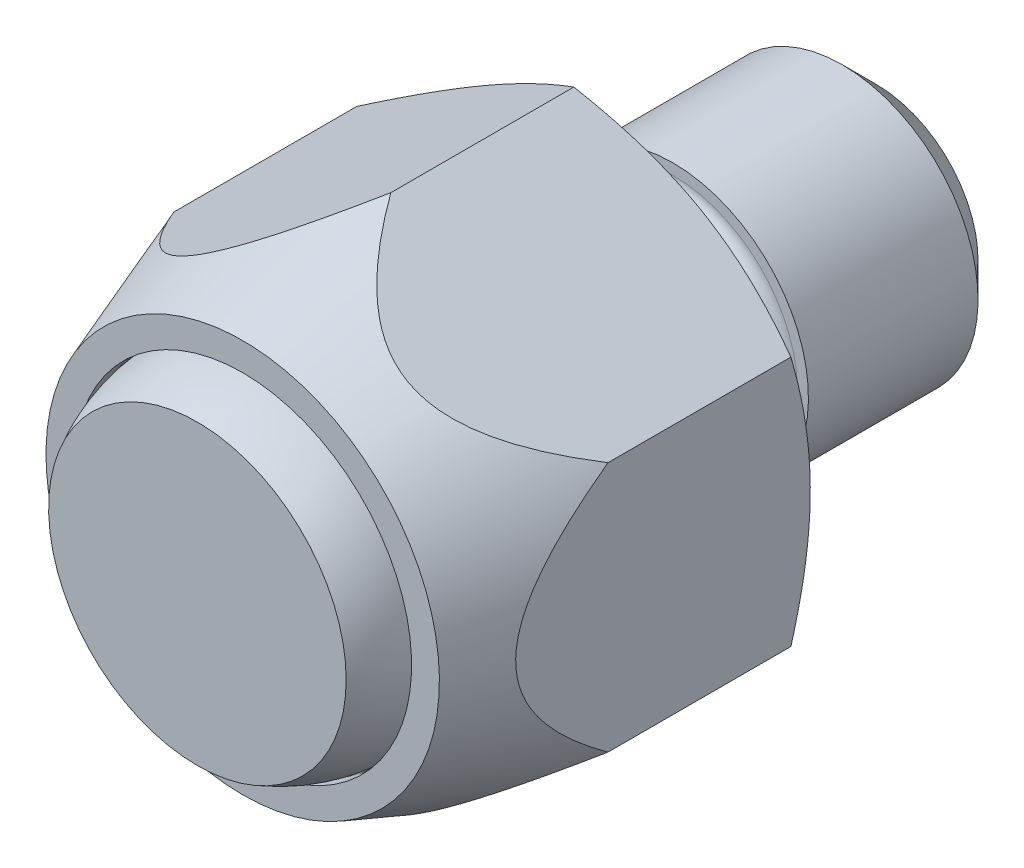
ISO-10303-21;
HEADER;
FILE_DESCRIPTION(('STEP AP214'),'2;1');
FILE_NAME('part.step','',(''),(''),'','','');
FILE_SCHEMA(('AUTOMOTIVE_DESIGN { 1 0 10303 214 1 1 1 1 }'));
ENDSEC;
DATA;
#1=APPLICATION_CONTEXT('core data for automotive mechanical design processes');
#2=APPLICATION_PROTOCOL_DEFINITION('international standard','automotive_design',2000,#1);
#3=PRODUCT_CONTEXT('',#1,'mechanical');
#4=PRODUCT('Part','Part','',(#3));
#5=PRODUCT_RELATED_PRODUCT_CATEGORY('part','',(#4));
#6=PRODUCT_DEFINITION_FORMATION('','',#4);
#7=PRODUCT_DEFINITION_CONTEXT('part definition',#1,'design');
#8=PRODUCT_DEFINITION('design','',#6,#7);
#9=PRODUCT_DEFINITION_SHAPE('','',#8);
#10=(LENGTH_UNIT() NAMED_UNIT(*) SI_UNIT(.MILLI.,.METRE.));
#11=(NAMED_UNIT(*) PLANE_ANGLE_UNIT() SI_UNIT($,.RADIAN.));
#12=(NAMED_UNIT(*) SI_UNIT($,.STERADIAN.) SOLID_ANGLE_UNIT());
#13=UNCERTAINTY_MEASURE_WITH_UNIT(LENGTH_MEASURE(1.E-05),#10,'distance_accuracy_value','');
#14=(GEOMETRIC_REPRESENTATION_CONTEXT(3) GLOBAL_UNCERTAINTY_ASSIGNED_CONTEXT((#13)) GLOBAL_UNIT_ASSIGNED_CONTEXT((#10,
#11,#12)) REPRESENTATION_CONTEXT('',''));
#15=CARTESIAN_POINT('',(0.,0.,0.));
#16=DIRECTION('',(0.,0.,1.));
#17=DIRECTION('',(1.,0.,0.));
#18=AXIS2_PLACEMENT_3D('',#15,#16,#17);
#19=CARTESIAN_POINT('',(0.,0.,25.05));
#20=DIRECTION('',(0.,0.,1.));
#21=DIRECTION('',(0.,-1.,0.));
#22=AXIS2_PLACEMENT_3D('',#19,#20,#21);
#23=PLANE('',#22);
#24=CARTESIAN_POINT('',(0.,0.,25.05));
#25=DIRECTION('',(0.,0.,1.));
#26=DIRECTION('',(0.,-1.,0.));
#27=AXIS2_PLACEMENT_3D('',#24,#25,#26);
#28=CIRCLE('',#27,12.5);
#29=CARTESIAN_POINT('',(0.,-12.5,25.05));
#30=VERTEX_POINT('',#29);
#31=EDGE_CURVE('E127',#30,#30,#28,.T.);
#32=ORIENTED_EDGE('',*,*,#31,.T.);
#33=EDGE_LOOP('',(#32));
#34=FACE_BOUND('',#33,.T.);
#35=CARTESIAN_POINT('',(0.,0.,25.05));
#36=DIRECTION('',(0.,0.,1.));
#37=DIRECTION('',(0.,-1.,0.));
#38=AXIS2_PLACEMENT_3D('',#35,#36,#37);
#39=CIRCLE('',#38,12.459036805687);
#40=CARTESIAN_POINT('',(0.,-12.459036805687,25.05));
#41=VERTEX_POINT('',#40);
#42=EDGE_CURVE('E9',#41,#41,#39,.T.);
#43=ORIENTED_EDGE('',*,*,#42,.F.);
#44=EDGE_LOOP('',(#43));
#45=FACE_BOUND('',#44,.T.);
#46=ADVANCED_FACE('F14',(#34,#45),#23,.T.);
#47=CARTESIAN_POINT('',(-16.,-9.23760430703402,26.7));
#48=DIRECTION('',(0.5,0.866025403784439,0.));
#49=DIRECTION('',(-0.866025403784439,0.5,0.));
#50=AXIS2_PLACEMENT_3D('',#47,#48,#49);
#51=PLANE('',#50);
#52=CARTESIAN_POINT('',(0.000199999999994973,-18.4753240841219,2.29515443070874));
#53=CARTESIAN_POINT('',(-0.351473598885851,-18.2722852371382,2.17793771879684));
#54=CARTESIAN_POINT('',(-0.704518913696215,-18.0684544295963,2.06604009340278));
#55=CARTESIAN_POINT('',(-1.41344054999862,-17.6591583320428,1.85436153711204));
#56=CARTESIAN_POINT('',(-1.76931776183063,-17.4536925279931,1.75458459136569));
#57=CARTESIAN_POINT('',(-2.48459095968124,-17.04072935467,1.56848860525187));
#58=CARTESIAN_POINT('',(-2.8439932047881,-16.8332283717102,1.48220140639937));
#59=CARTESIAN_POINT('',(-3.56529510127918,-16.416784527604,1.32493775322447));
#60=CARTESIAN_POINT('',(-3.92719460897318,-16.2078417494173,1.25396042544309));
#61=CARTESIAN_POINT('',(-4.64421780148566,-15.793868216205,1.13033542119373));
#62=CARTESIAN_POINT('',(-4.99928825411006,-15.5888681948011,1.07727856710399));
#63=CARTESIAN_POINT('',(-5.71105615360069,-15.1779288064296,0.988314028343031));
#64=CARTESIAN_POINT('',(-6.06775363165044,-14.9719894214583,0.952406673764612));
#65=CARTESIAN_POINT('',(-6.78174778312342,-14.5597647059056,0.898647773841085));
#66=CARTESIAN_POINT('',(-7.13904323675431,-14.3534800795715,0.880774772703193));
#67=CARTESIAN_POINT('',(-7.85396395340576,-13.9407204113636,0.863468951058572));
#68=CARTESIAN_POINT('',(-8.21158920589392,-13.7342453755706,0.864035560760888));
#69=CARTESIAN_POINT('',(-8.88016607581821,-13.3482423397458,0.882320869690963));
#70=CARTESIAN_POINT('',(-9.19116534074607,-13.1686868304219,0.897809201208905));
#71=CARTESIAN_POINT('',(-9.81244849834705,-12.809988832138,0.942438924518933));
#72=CARTESIAN_POINT('',(-10.1227323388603,-12.6308463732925,0.971581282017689));
#73=CARTESIAN_POINT('',(-10.7424161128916,-12.2730717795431,1.04301094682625));
#74=CARTESIAN_POINT('',(-11.0518151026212,-12.0944401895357,1.08530911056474));
#75=CARTESIAN_POINT('',(-11.6691625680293,-11.7380144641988,1.1823082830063));
#76=CARTESIAN_POINT('',(-11.9771109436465,-11.5602203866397,1.23701013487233));
#77=CARTESIAN_POINT('',(-12.9119052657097,-11.0205166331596,1.42110400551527));
#78=CARTESIAN_POINT('',(-13.5360442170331,-10.6601698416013,1.56885201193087));
#79=CARTESIAN_POINT('',(-14.7750155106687,-9.94484943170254,1.90417943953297));
#80=CARTESIAN_POINT('',(-15.3898637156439,-9.58986665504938,2.09168010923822));
#81=CARTESIAN_POINT('',(-16.0002,-9.23748883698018,2.29515443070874));
#82=B_SPLINE_CURVE_WITH_KNOTS('',3,(#52,#53,#54,#55,#56,#57,#58,#59,#60,#61,#62,#63,#64,#65,#66,
#67,#68,#69,#70,#71,#72,#73,#74,#75,#76,#77,#78,#79,#80,#81),.UNSPECIFIED.,.F.,.F.,(4,2,2,2,2,2,
2,2,2,2,2,2,2,2,4),(0.,1.26800386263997,2.53642350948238,3.80779337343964,5.0790906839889,
6.31900943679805,7.5589520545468,8.79741774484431,10.0358451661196,11.1139198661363,
12.1920708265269,13.2711138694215,14.350230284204,16.5559177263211,18.7572757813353),.UNSPECIFIED.);
#83=CARTESIAN_POINT('',(0.,-18.475208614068,2.29508776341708));
#84=VERTEX_POINT('',#83);
#85=CARTESIAN_POINT('',(-16.,-9.23760430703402,2.29508776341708));
#86=VERTEX_POINT('',#85);
#87=EDGE_CURVE('E31',#84,#86,#82,.T.);
#88=ORIENTED_EDGE('',*,*,#87,.F.);
#89=DIRECTION('',(0.,0.,-1.));
#90=VECTOR('',#89,1.);
#91=CARTESIAN_POINT('',(0.,-18.475208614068,26.7));
#92=LINE('',#91,#90);
#93=CARTESIAN_POINT('',(0.,-18.475208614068,15.7782040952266));
#94=VERTEX_POINT('',#93);
#95=EDGE_CURVE('E101',#94,#84,#92,.T.);
#96=ORIENTED_EDGE('',*,*,#95,.F.);
#97=CARTESIAN_POINT('',(-16.0002,-9.23748883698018,15.7778868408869));
#98=CARTESIAN_POINT('',(-15.8559477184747,-9.32077293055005,16.0066705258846));
#99=CARTESIAN_POINT('',(-15.7098067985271,-9.40514743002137,16.2338898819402));
#100=CARTESIAN_POINT('',(-15.4132166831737,-9.57638381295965,16.6846421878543));
#101=CARTESIAN_POINT('',(-15.2627663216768,-9.66324636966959,16.9081741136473));
#102=CARTESIAN_POINT('',(-14.9560063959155,-9.84035429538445,17.352458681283));
#103=CARTESIAN_POINT('',(-14.7996624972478,-9.93061948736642,17.573179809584));
#104=CARTESIAN_POINT('',(-14.4815555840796,-10.1142785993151,18.0093344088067));
#105=CARTESIAN_POINT('',(-14.3197930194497,-10.207672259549,18.2247683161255));
#106=CARTESIAN_POINT('',(-13.9837480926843,-10.4016878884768,18.6575553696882));
#107=CARTESIAN_POINT('',(-13.8092234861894,-10.5024497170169,18.8746586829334));
#108=CARTESIAN_POINT('',(-13.4526886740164,-10.7082951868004,19.3005001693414));
#109=CARTESIAN_POINT('',(-13.2706793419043,-10.8133783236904,19.5092393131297));
#110=CARTESIAN_POINT('',(-12.89865598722,-11.0281661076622,19.9158098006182));
#111=CARTESIAN_POINT('',(-12.7086655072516,-11.1378571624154,20.1136697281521));
#112=CARTESIAN_POINT('',(-12.3191745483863,-11.3627298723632,20.4964077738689));
#113=CARTESIAN_POINT('',(-12.1196783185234,-11.4779090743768,20.6812916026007));
#114=CARTESIAN_POINT('',(-11.7635781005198,-11.6835036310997,20.9884451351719));
#115=CARTESIAN_POINT('',(-11.6093937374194,-11.7725220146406,21.1144490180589));
#116=CARTESIAN_POINT('',(-11.2947704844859,-11.9541698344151,21.3557458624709));
#117=CARTESIAN_POINT('',(-11.1343302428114,-12.0468000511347,21.4710364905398));
#118=CARTESIAN_POINT('',(-10.8079883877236,-12.2352136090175,21.6880656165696));
#119=CARTESIAN_POINT('',(-10.6421263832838,-12.3309740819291,21.7898830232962));
#120=CARTESIAN_POINT('',(-10.3040380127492,-12.5261694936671,21.978333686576));
#121=CARTESIAN_POINT('',(-10.1318133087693,-12.625603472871,22.064970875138));
#122=CARTESIAN_POINT('',(-9.81465930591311,-12.8087124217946,22.2056537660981));
#123=CARTESIAN_POINT('',(-9.67075119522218,-12.8917978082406,22.262764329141));
#124=CARTESIAN_POINT('',(-9.37952536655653,-13.0599371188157,22.3638432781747));
#125=CARTESIAN_POINT('',(-9.23220858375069,-13.1449905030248,22.4078152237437));
#126=CARTESIAN_POINT('',(-8.93494193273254,-13.3166174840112,22.4813363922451));
#127=CARTESIAN_POINT('',(-8.78499316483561,-13.4031904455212,22.5108915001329));
#128=CARTESIAN_POINT('',(-8.48340978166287,-13.5773096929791,22.5546354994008));
#129=CARTESIAN_POINT('',(-8.33177517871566,-13.6648559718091,22.5688245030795));
#130=CARTESIAN_POINT('',(-8.02744257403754,-13.8405624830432,22.5813575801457));
#131=CARTESIAN_POINT('',(-7.87474271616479,-13.9287237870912,22.5796422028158));
#132=CARTESIAN_POINT('',(-7.57011124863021,-14.104602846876,22.560286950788));
#133=CARTESIAN_POINT('',(-7.41817963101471,-14.1923206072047,22.5426472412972));
#134=CARTESIAN_POINT('',(-7.11628864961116,-14.3666174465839,22.492069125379));
#135=CARTESIAN_POINT('',(-6.96632885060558,-14.4531967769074,22.4591341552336));
#136=CARTESIAN_POINT('',(-6.66923077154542,-14.6247264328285,22.3790140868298));
#137=CARTESIAN_POINT('',(-6.5220942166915,-14.7096757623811,22.3318205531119));
#138=CARTESIAN_POINT('',(-6.18584997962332,-14.9038064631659,22.2076998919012));
#139=CARTESIAN_POINT('',(-5.99803719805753,-15.0122402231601,22.1260895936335));
#140=CARTESIAN_POINT('',(-5.62944149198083,-15.2250490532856,21.9438541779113));
#141=CARTESIAN_POINT('',(-5.44866261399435,-15.3294217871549,21.8432183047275));
#142=CARTESIAN_POINT('',(-5.09282026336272,-15.5348674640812,21.6251148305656));
#143=CARTESIAN_POINT('',(-4.91782430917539,-15.6359014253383,21.5075014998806));
#144=CARTESIAN_POINT('',(-4.57517373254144,-15.8337308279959,21.2590142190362));
#145=CARTESIAN_POINT('',(-4.40751710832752,-15.9305274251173,21.1281439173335));
#146=CARTESIAN_POINT('',(-4.02765963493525,-16.149838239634,20.8128100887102));
#147=CARTESIAN_POINT('',(-3.81793038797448,-16.2709254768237,20.6243878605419));
#148=CARTESIAN_POINT('',(-3.40898267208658,-16.5070315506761,20.2328246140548));
#149=CARTESIAN_POINT('',(-3.20976946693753,-16.622047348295,20.0296763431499));
#150=CARTESIAN_POINT('',(-2.82002495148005,-16.8470664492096,19.6111209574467));
#151=CARTESIAN_POINT('',(-2.62952573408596,-16.9570512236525,19.3956742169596));
#152=CARTESIAN_POINT('',(-2.25681273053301,-17.1722371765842,18.9555511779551));
#153=CARTESIAN_POINT('',(-2.07459746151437,-17.2774392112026,18.7308765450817));
#154=CARTESIAN_POINT('',(-1.7261630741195,-17.4786078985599,18.285242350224));
#155=CARTESIAN_POINT('',(-1.55959783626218,-17.5747743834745,18.0646420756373));
#156=CARTESIAN_POINT('',(-1.23222707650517,-17.763781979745,17.6177963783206));
#157=CARTESIAN_POINT('',(-1.07142205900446,-17.8566227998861,17.3915504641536));
#158=CARTESIAN_POINT('',(-0.756246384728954,-18.0385895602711,16.9362533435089));
#159=CARTESIAN_POINT('',(-0.601833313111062,-18.1277399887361,16.7072411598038));
#160=CARTESIAN_POINT('',(-0.297553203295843,-18.3034161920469,16.245327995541));
#161=CARTESIAN_POINT('',(-0.1476848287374,-18.3899427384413,16.012428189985));
#162=CARTESIAN_POINT('',(0.000200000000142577,-18.475324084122,15.7778868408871));
#163=B_SPLINE_CURVE_WITH_KNOTS('',3,(#97,#98,#99,#100,#101,#102,#103,#104,#105,#106,#107,#108,
#109,#110,#111,#112,#113,#114,#115,#116,#117,#118,#119,#120,#121,#122,#123,#124,#125,#126,#127,
#128,#129,#130,#131,#132,#133,#134,#135,#136,#137,#138,#139,#140,#141,#142,#143,#144,#145,#146,
#147,#148,#149,#150,#151,#152,#153,#154,#155,#156,#157,#158,#159,#160,#161,#162),.UNSPECIFIED.,
.F.,.F.,(4,2,2,2,2,2,2,2,2,2,2,2,2,2,2,2,2,2,2,2,2,2,2,2,2,2,2,2,2,2,2,2,4),(0.,
0.849004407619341,1.69824075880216,2.55357954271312,3.40884748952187,4.29729848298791,
5.18564607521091,6.07153559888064,6.95703278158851,7.61105973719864,8.26522881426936,
8.9153788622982,9.56536025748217,10.092015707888,10.6185283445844,11.1448258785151,
11.6711195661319,12.1993813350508,12.7276376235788,13.2557752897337,13.7842260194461,
14.4782612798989,15.1726900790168,15.8734796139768,16.574076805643,17.4938308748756,
18.4140410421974,19.3374048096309,20.2606026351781,21.1384689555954,22.0164119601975,
22.8870476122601,23.7574247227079),.UNSPECIFIED.);
#164=CARTESIAN_POINT('',(-16.,-9.23760430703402,15.7782040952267));
#165=VERTEX_POINT('',#164);
#166=EDGE_CURVE('E205',#165,#94,#163,.T.);
#167=ORIENTED_EDGE('',*,*,#166,.F.);
#168=DIRECTION('',(0.,0.,-1.));
#169=VECTOR('',#168,1.);
#170=CARTESIAN_POINT('',(-16.,-9.23760430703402,26.7));
#171=LINE('',#170,#169);
#172=EDGE_CURVE('E88',#165,#86,#171,.T.);
#173=ORIENTED_EDGE('',*,*,#172,.T.);
#174=EDGE_LOOP('',(#88,#96,#167,#173));
#175=FACE_BOUND('',#174,.T.);
#176=ADVANCED_FACE('F215',(#175),#51,.F.);
#177=CARTESIAN_POINT('',(0.,-18.475208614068,26.7));
#178=DIRECTION('',(-0.5,0.866025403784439,0.));
#179=DIRECTION('',(-0.866025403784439,-0.5,0.));
#180=AXIS2_PLACEMENT_3D('',#177,#178,#179);
#181=PLANE('',#180);
#182=CARTESIAN_POINT('',(16.0002,-9.23748883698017,2.29515443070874));
#183=CARTESIAN_POINT('',(15.6485264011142,-9.44052768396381,2.17793771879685));
#184=CARTESIAN_POINT('',(15.2954810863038,-9.64435849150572,2.06604009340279));
#185=CARTESIAN_POINT('',(14.5865594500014,-10.0536545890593,1.85436153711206));
#186=CARTESIAN_POINT('',(14.2306822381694,-10.2591203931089,1.7545845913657));
#187=CARTESIAN_POINT('',(13.5154090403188,-10.6720835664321,1.56848860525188));
#188=CARTESIAN_POINT('',(13.1560067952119,-10.8795845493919,1.48220140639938));
#189=CARTESIAN_POINT('',(12.4347048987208,-11.296028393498,1.32493775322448));
#190=CARTESIAN_POINT('',(12.0728053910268,-11.5049711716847,1.2539604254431));
#191=CARTESIAN_POINT('',(11.3557821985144,-11.918944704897,1.13033542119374));
#192=CARTESIAN_POINT('',(11.00071174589,-12.123944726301,1.077278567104));
#193=CARTESIAN_POINT('',(10.2889438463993,-12.5348841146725,0.988314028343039));
#194=CARTESIAN_POINT('',(9.93224636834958,-12.7408234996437,0.95240667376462));
#195=CARTESIAN_POINT('',(9.2182522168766,-13.1530482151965,0.898647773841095));
#196=CARTESIAN_POINT('',(8.8609567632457,-13.3593328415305,0.880774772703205));
#197=CARTESIAN_POINT('',(8.14603604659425,-13.7720925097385,0.863468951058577));
#198=CARTESIAN_POINT('',(7.78841079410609,-13.9785675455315,0.864035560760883));
#199=CARTESIAN_POINT('',(7.1198339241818,-14.3645705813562,0.88232086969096));
#200=CARTESIAN_POINT('',(6.80883465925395,-14.5441260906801,0.897809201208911));
#201=CARTESIAN_POINT('',(6.18755150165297,-14.902824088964,0.942438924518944));
#202=CARTESIAN_POINT('',(5.8772676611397,-15.0819665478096,0.971581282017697));
#203=CARTESIAN_POINT('',(5.25758388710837,-15.439741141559,1.04301094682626));
#204=CARTESIAN_POINT('',(4.94818489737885,-15.6183727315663,1.08530911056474));
#205=CARTESIAN_POINT('',(4.33083743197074,-15.9747984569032,1.18230828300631));
#206=CARTESIAN_POINT('',(4.02288905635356,-16.1525925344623,1.23701013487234));
#207=CARTESIAN_POINT('',(3.08809473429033,-16.6922962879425,1.42110400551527));
#208=CARTESIAN_POINT('',(2.46395578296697,-17.0526430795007,1.56885201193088));
#209=CARTESIAN_POINT('',(1.22498448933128,-17.7679634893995,1.90417943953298));
#210=CARTESIAN_POINT('',(0.610136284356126,-18.1229462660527,2.09168010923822));
#211=CARTESIAN_POINT('',(-0.000200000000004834,-18.4753240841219,2.29515443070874));
#212=B_SPLINE_CURVE_WITH_KNOTS('',3,(#182,#183,#184,#185,#186,#187,#188,#189,#190,#191,#192,
#193,#194,#195,#196,#197,#198,#199,#200,#201,#202,#203,#204,#205,#206,#207,#208,#209,#210,#211),
.UNSPECIFIED.,.F.,.F.,(4,2,2,2,2,2,2,2,2,2,2,2,2,2,4),(0.,1.26800386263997,2.53642350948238,
3.80779337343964,5.0790906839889,6.31900943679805,7.5589520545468,8.79741774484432,
10.0358451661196,11.1139198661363,12.1920708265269,13.2711138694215,14.350230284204,
16.5559177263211,18.7572757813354),.UNSPECIFIED.);
#213=CARTESIAN_POINT('',(16.,-9.23760430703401,2.29508776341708));
#214=VERTEX_POINT('',#213);
#215=EDGE_CURVE('E222',#214,#84,#212,.T.);
#216=ORIENTED_EDGE('',*,*,#215,.F.);
#217=DIRECTION('',(0.,0.,-1.));
#218=VECTOR('',#217,1.);
#219=CARTESIAN_POINT('',(16.,-9.23760430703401,26.7));
#220=LINE('',#219,#218);
#221=CARTESIAN_POINT('',(16.,-9.23760430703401,15.7782040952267));
#222=VERTEX_POINT('',#221);
#223=EDGE_CURVE('E98',#222,#214,#220,.T.);
#224=ORIENTED_EDGE('',*,*,#223,.F.);
#225=CARTESIAN_POINT('',(-0.000200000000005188,-18.4753240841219,15.7778868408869));
#226=CARTESIAN_POINT('',(0.14405228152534,-18.392039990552,16.0066705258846));
#227=CARTESIAN_POINT('',(0.290193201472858,-18.3076654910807,16.2338898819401));
#228=CARTESIAN_POINT('',(0.58678331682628,-18.1364291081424,16.6846421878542));
#229=CARTESIAN_POINT('',(0.737233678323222,-18.0495665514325,16.9081741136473));
#230=CARTESIAN_POINT('',(1.0439936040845,-17.8724586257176,17.3524586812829));
#231=CARTESIAN_POINT('',(1.20033750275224,-17.7821934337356,17.573179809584));
#232=CARTESIAN_POINT('',(1.5184444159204,-17.5985343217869,18.0093344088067));
#233=CARTESIAN_POINT('',(1.68020698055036,-17.505140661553,18.2247683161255));
#234=CARTESIAN_POINT('',(2.01625190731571,-17.3111250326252,18.6575553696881));
#235=CARTESIAN_POINT('',(2.19077651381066,-17.2103632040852,18.8746586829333));
#236=CARTESIAN_POINT('',(2.54731132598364,-17.0045177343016,19.3005001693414));
#237=CARTESIAN_POINT('',(2.72932065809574,-16.8994345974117,19.5092393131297));
#238=CARTESIAN_POINT('',(3.10134401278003,-16.6846468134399,19.9158098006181));
#239=CARTESIAN_POINT('',(3.29133449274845,-16.5749557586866,20.1136697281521));
#240=CARTESIAN_POINT('',(3.6808254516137,-16.3500830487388,20.4964077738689));
#241=CARTESIAN_POINT('',(3.88032168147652,-16.2349038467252,20.6812916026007));
#242=CARTESIAN_POINT('',(4.23642189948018,-16.0293092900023,20.9884451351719));
#243=CARTESIAN_POINT('',(4.39060626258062,-15.9402909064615,21.1144490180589));
#244=CARTESIAN_POINT('',(4.70522951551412,-15.758643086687,21.3557458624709));
#245=CARTESIAN_POINT('',(4.86566975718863,-15.6660128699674,21.4710364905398));
#246=CARTESIAN_POINT('',(5.19201161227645,-15.4775993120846,21.6880656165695));
#247=CARTESIAN_POINT('',(5.3578736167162,-15.381838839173,21.7898830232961));
#248=CARTESIAN_POINT('',(5.69596198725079,-15.1866434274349,21.978333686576));
#249=CARTESIAN_POINT('',(5.86818669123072,-15.087209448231,22.064970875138));
#250=CARTESIAN_POINT('',(6.18534069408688,-14.9041004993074,22.2056537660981));
#251=CARTESIAN_POINT('',(6.32924880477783,-14.8210151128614,22.262764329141));
#252=CARTESIAN_POINT('',(6.62047463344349,-14.6528758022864,22.3638432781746));
#253=CARTESIAN_POINT('',(6.76779141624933,-14.5678224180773,22.4078152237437));
#254=CARTESIAN_POINT('',(7.06505806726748,-14.3961954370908,22.4813363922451));
#255=CARTESIAN_POINT('',(7.21500683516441,-14.3096224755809,22.5108915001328));
#256=CARTESIAN_POINT('',(7.51659021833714,-14.135503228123,22.5546354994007));
#257=CARTESIAN_POINT('',(7.66822482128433,-14.0479569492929,22.5688245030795));
#258=CARTESIAN_POINT('',(7.97255742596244,-13.8722504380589,22.5813575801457));
#259=CARTESIAN_POINT('',(8.1252572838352,-13.7840891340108,22.5796422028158));
#260=CARTESIAN_POINT('',(8.42988875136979,-13.6082100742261,22.560286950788));
#261=CARTESIAN_POINT('',(8.58182036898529,-13.5204923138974,22.5426472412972));
#262=CARTESIAN_POINT('',(8.88371135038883,-13.3461954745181,22.4920691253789));
#263=CARTESIAN_POINT('',(9.03367114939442,-13.2596161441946,22.4591341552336));
#264=CARTESIAN_POINT('',(9.33076922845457,-13.0880864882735,22.3790140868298));
#265=CARTESIAN_POINT('',(9.47790578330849,-13.0031371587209,22.3318205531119));
#266=CARTESIAN_POINT('',(9.81415002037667,-12.8090064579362,22.2076998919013));
#267=CARTESIAN_POINT('',(10.0019628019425,-12.7005726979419,22.1260895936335));
#268=CARTESIAN_POINT('',(10.3705585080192,-12.4877638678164,21.9438541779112));
#269=CARTESIAN_POINT('',(10.5513373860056,-12.3833911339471,21.8432183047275));
#270=CARTESIAN_POINT('',(10.9071797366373,-12.1779454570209,21.6251148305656));
#271=CARTESIAN_POINT('',(11.0821756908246,-12.0769114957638,21.5075014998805));
#272=CARTESIAN_POINT('',(11.4248262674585,-11.8790820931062,21.2590142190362));
#273=CARTESIAN_POINT('',(11.5924828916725,-11.7822854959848,21.1281439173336));
#274=CARTESIAN_POINT('',(11.9723403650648,-11.5629746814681,20.8128100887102));
#275=CARTESIAN_POINT('',(12.1820696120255,-11.4418874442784,20.6243878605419));
#276=CARTESIAN_POINT('',(12.5910173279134,-11.205781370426,20.2328246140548));
#277=CARTESIAN_POINT('',(12.7902305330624,-11.0907655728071,20.0296763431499));
#278=CARTESIAN_POINT('',(13.1799750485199,-10.8657464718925,19.6111209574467));
#279=CARTESIAN_POINT('',(13.370474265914,-10.7557616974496,19.3956742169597));
#280=CARTESIAN_POINT('',(13.7431872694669,-10.5405757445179,18.9555511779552));
#281=CARTESIAN_POINT('',(13.9254025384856,-10.4353737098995,18.7308765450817));
#282=CARTESIAN_POINT('',(14.2738369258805,-10.2342050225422,18.2852423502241));
#283=CARTESIAN_POINT('',(14.4404021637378,-10.1380385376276,18.0646420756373));
#284=CARTESIAN_POINT('',(14.7677729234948,-9.94903094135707,17.6177963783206));
#285=CARTESIAN_POINT('',(14.9285779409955,-9.85619012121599,17.3915504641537));
#286=CARTESIAN_POINT('',(15.243753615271,-9.674223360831,16.936253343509));
#287=CARTESIAN_POINT('',(15.3981666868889,-9.58507293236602,16.7072411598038));
#288=CARTESIAN_POINT('',(15.7024467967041,-9.40939672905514,16.245327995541));
#289=CARTESIAN_POINT('',(15.8523151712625,-9.3228701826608,16.012428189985));
#290=CARTESIAN_POINT('',(16.0002,-9.23748883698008,15.7778868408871));
#291=B_SPLINE_CURVE_WITH_KNOTS('',3,(#225,#226,#227,#228,#229,#230,#231,#232,#233,#234,#235,
#236,#237,#238,#239,#240,#241,#242,#243,#244,#245,#246,#247,#248,#249,#250,#251,#252,#253,#254,
#255,#256,#257,#258,#259,#260,#261,#262,#263,#264,#265,#266,#267,#268,#269,#270,#271,#272,#273,
#274,#275,#276,#277,#278,#279,#280,#281,#282,#283,#284,#285,#286,#287,#288,#289,#290),
.UNSPECIFIED.,.F.,.F.,(4,2,2,2,2,2,2,2,2,2,2,2,2,2,2,2,2,2,2,2,2,2,2,2,2,2,2,2,2,2,2,2,4),(0.,
0.849004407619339,1.69824075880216,2.55357954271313,3.40884748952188,4.29729848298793,
5.18564607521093,6.07153559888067,6.95703278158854,7.61105973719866,8.26522881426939,
8.91537886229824,9.56536025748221,10.092015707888,10.6185283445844,11.1448258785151,
11.6711195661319,12.1993813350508,12.7276376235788,13.2557752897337,13.7842260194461,
14.4782612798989,15.1726900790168,15.8734796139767,16.574076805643,17.4938308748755,
18.4140410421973,19.3374048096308,20.260602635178,21.1384689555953,22.0164119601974,
22.88704761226,23.7574247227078),.UNSPECIFIED.);
#292=EDGE_CURVE('E199',#94,#222,#291,.T.);
#293=ORIENTED_EDGE('',*,*,#292,.F.);
#294=ORIENTED_EDGE('',*,*,#95,.T.);
#295=EDGE_LOOP('',(#216,#224,#293,#294));
#296=FACE_BOUND('',#295,.T.);
#297=ADVANCED_FACE('F211',(#296),#181,.F.);
#298=CARTESIAN_POINT('',(16.,-9.23760430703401,26.7));
#299=DIRECTION('',(-1.,0.,0.));
#300=DIRECTION('',(0.,0.,-1.));
#301=AXIS2_PLACEMENT_3D('',#298,#299,#300);
#302=PLANE('',#301);
#303=CARTESIAN_POINT('',(16.,25.0359655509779,8.7826195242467));
#304=CARTESIAN_POINT('',(16.,24.6855456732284,8.61214756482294));
#305=CARTESIAN_POINT('',(16.,24.3347204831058,8.44250915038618));
#306=CARTESIAN_POINT('',(16.,23.6321749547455,8.10508780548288));
#307=CARTESIAN_POINT('',(16.,23.2804546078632,7.93730489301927));
#308=CARTESIAN_POINT('',(16.,22.2237333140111,7.43697915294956));
#309=CARTESIAN_POINT('',(16.,21.5172724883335,7.10750828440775));
#310=CARTESIAN_POINT('',(16.,20.0959583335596,6.45698406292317));
#311=CARTESIAN_POINT('',(16.,19.3810803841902,6.13598437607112));
#312=CARTESIAN_POINT('',(16.,17.9457150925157,5.50682653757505));
#313=CARTESIAN_POINT('',(16.,17.2252280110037,5.19866779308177));
#314=CARTESIAN_POINT('',(16.,15.753694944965,4.58871699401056));
#315=CARTESIAN_POINT('',(16.,15.0024230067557,4.28746727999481));
#316=CARTESIAN_POINT('',(16.,13.49116804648,3.70723207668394));
#317=CARTESIAN_POINT('',(16.,12.731184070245,3.42824905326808));
#318=CARTESIAN_POINT('',(16.,11.2026705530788,2.89971069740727));
#319=CARTESIAN_POINT('',(16.,10.4341610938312,2.65009774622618));
#320=CARTESIAN_POINT('',(16.,8.88605011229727,2.18814508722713));
#321=CARTESIAN_POINT('',(16.,8.10645209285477,1.9757938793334));
#322=CARTESIAN_POINT('',(16.,6.93067630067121,1.69334909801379));
#323=CARTESIAN_POINT('',(16.,6.53876203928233,1.60540509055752));
#324=CARTESIAN_POINT('',(16.,5.75221503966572,1.4425808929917));
#325=CARTESIAN_POINT('',(16.,5.35758235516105,1.36770044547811));
#326=CARTESIAN_POINT('',(16.,4.56585566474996,1.23231127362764));
#327=CARTESIAN_POINT('',(16.,4.16876171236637,1.17180223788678));
#328=CARTESIAN_POINT('',(16.,3.372515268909,1.06635408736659));
#329=CARTESIAN_POINT('',(16.,2.97336286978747,1.02141428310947));
#330=CARTESIAN_POINT('',(16.,2.17886591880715,0.94857331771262));
#331=CARTESIAN_POINT('',(16.,1.78354159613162,0.920452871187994));
#332=CARTESIAN_POINT('',(16.,0.992058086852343,0.880965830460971));
#333=CARTESIAN_POINT('',(16.,0.595898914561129,0.869598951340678));
#334=CARTESIAN_POINT('',(16.,-0.196550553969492,0.863890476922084));
#335=CARTESIAN_POINT('',(16.,-0.592840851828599,0.869549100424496));
#336=CARTESIAN_POINT('',(16.,-1.384823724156,0.897751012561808));
#337=CARTESIAN_POINT('',(16.,-1.78051627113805,0.920295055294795));
#338=CARTESIAN_POINT('',(16.,-2.72456767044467,0.993741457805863));
#339=CARTESIAN_POINT('',(16.,-3.27234633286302,1.05227012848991));
#340=CARTESIAN_POINT('',(16.,-4.3639593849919,1.19854624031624));
#341=CARTESIAN_POINT('',(16.,-4.90779325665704,1.28629745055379));
#342=CARTESIAN_POINT('',(16.,-6.53266453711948,1.58874116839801));
#343=CARTESIAN_POINT('',(16.,-7.60651949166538,1.84257501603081));
#344=CARTESIAN_POINT('',(16.,-9.21302418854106,2.28441822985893));
#345=CARTESIAN_POINT('',(16.,-9.75395359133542,2.44406635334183));
#346=CARTESIAN_POINT('',(16.,-10.830559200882,2.78034410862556));
#347=CARTESIAN_POINT('',(16.,-11.3662353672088,2.95697387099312));
#348=CARTESIAN_POINT('',(16.,-12.4325074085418,3.32434919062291));
#349=CARTESIAN_POINT('',(16.,-12.9631047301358,3.51509058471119));
#350=CARTESIAN_POINT('',(16.,-13.7556754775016,3.81007270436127));
#351=CARTESIAN_POINT('',(16.,-14.0193099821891,3.90987780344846));
#352=CARTESIAN_POINT('',(16.,-14.5455378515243,4.11219897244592));
#353=CARTESIAN_POINT('',(16.,-14.8081312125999,4.21471505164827));
#354=CARTESIAN_POINT('',(16.,-15.5222453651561,4.49739885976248));
#355=CARTESIAN_POINT('',(16.,-15.972799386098,4.6800110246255));
#356=CARTESIAN_POINT('',(16.,-16.8712952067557,5.05156471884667));
#357=CARTESIAN_POINT('',(16.,-17.31923694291,5.24050640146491));
#358=CARTESIAN_POINT('',(16.,-18.2128140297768,5.62386282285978));
#359=CARTESIAN_POINT('',(16.,-18.6584491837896,5.81827801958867));
#360=CARTESIAN_POINT('',(16.,-19.5476271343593,6.21184036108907));
#361=CARTESIAN_POINT('',(16.,-19.9911699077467,6.41098755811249));
#362=CARTESIAN_POINT('',(16.,-21.3193303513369,7.01472405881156));
#363=CARTESIAN_POINT('',(16.,-22.2011526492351,7.42546666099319));
#364=CARTESIAN_POINT('',(16.,-23.9587928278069,8.2594527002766));
#365=CARTESIAN_POINT('',(16.,-24.8346109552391,8.68269561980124));
#366=CARTESIAN_POINT('',(16.,-26.5828559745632,9.53963386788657));
#367=CARTESIAN_POINT('',(16.,-27.4552751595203,9.9733448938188));
#368=CARTESIAN_POINT('',(16.,-29.1962201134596,10.8485161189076));
#369=CARTESIAN_POINT('',(16.,-30.0647458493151,11.2899763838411));
#370=CARTESIAN_POINT('',(16.,-31.7984161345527,12.1790149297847));
#371=CARTESIAN_POINT('',(16.,-32.6635613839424,12.6265918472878));
#372=CARTESIAN_POINT('',(16.,-34.3912107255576,13.5268021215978));
#373=CARTESIAN_POINT('',(16.,-35.2537148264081,13.9794354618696));
#374=CARTESIAN_POINT('',(16.,-37.6535454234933,15.2462077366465));
#375=CARTESIAN_POINT('',(16.,-39.1884786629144,16.064879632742));
#376=CARTESIAN_POINT('',(16.,-42.2533062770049,17.7118079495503));
#377=CARTESIAN_POINT('',(16.,-43.7832003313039,18.5400649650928));
#378=CARTESIAN_POINT('',(16.,-46.8340154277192,20.2009485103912));
#379=CARTESIAN_POINT('',(16.,-48.3549493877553,21.033551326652));
#380=CARTESIAN_POINT('',(16.,-50.6340472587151,22.2864990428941));
#381=CARTESIAN_POINT('',(16.,-51.3933331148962,22.7048057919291));
#382=CARTESIAN_POINT('',(16.,-52.9112372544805,23.5426267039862));
#383=CARTESIAN_POINT('',(16.,-53.6698555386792,23.962140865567));
#384=CARTESIAN_POINT('',(16.,-54.4281810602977,24.3821836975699));
#385=B_SPLINE_CURVE_WITH_KNOTS('',3,(#303,#304,#305,#306,#307,#308,#309,#310,#311,#312,#313,
#314,#315,#316,#317,#318,#319,#320,#321,#322,#323,#324,#325,#326,#327,#328,#329,#330,#331,#332,
#333,#334,#335,#336,#337,#338,#339,#340,#341,#342,#343,#344,#345,#346,#347,#348,#349,#350,#351,
#352,#353,#354,#355,#356,#357,#358,#359,#360,#361,#362,#363,#364,#365,#366,#367,#368,#369,#370,
#371,#372,#373,#374,#375,#376,#377,#378,#379,#380,#381,#382,#383,#384),.UNSPECIFIED.,.F.,.F.,(4,
2,2,2,2,2,2,2,2,2,2,2,2,2,2,2,2,2,2,2,2,2,2,2,2,2,2,2,2,2,2,2,2,2,2,2,2,2,2,2,4),(0.,
1.16905441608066,2.33812016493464,4.67658668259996,7.02740747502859,9.37811961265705,
11.8061103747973,14.2343696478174,16.6577827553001,19.0804466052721,20.285244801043,
21.4900192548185,22.6947676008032,23.8994625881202,25.0880879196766,26.2766930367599,
27.4653134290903,28.6539869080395,30.3057487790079,31.9577237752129,35.2633290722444,
36.9551707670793,38.647025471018,40.338383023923,41.1840518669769,42.029723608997,
43.4881259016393,44.9465635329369,46.4051235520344,47.8636996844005,50.7819221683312,
53.7000239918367,56.6228130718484,59.545626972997,62.4677996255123,65.3899627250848,
70.6087403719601,75.8278436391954,81.0295786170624,83.6302431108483,86.2309045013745),.UNSPECIFIED.);
#386=CARTESIAN_POINT('',(16.,9.23760430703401,2.29508776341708));
#387=VERTEX_POINT('',#386);
#388=EDGE_CURVE('E229',#387,#214,#385,.T.);
#389=ORIENTED_EDGE('',*,*,#388,.F.);
#390=DIRECTION('',(0.,0.,-1.));
#391=VECTOR('',#390,1.);
#392=CARTESIAN_POINT('',(16.,9.23760430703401,26.7));
#393=LINE('',#392,#391);
#394=CARTESIAN_POINT('',(16.,9.23760430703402,15.7782040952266));
#395=VERTEX_POINT('',#394);
#396=EDGE_CURVE('E90',#395,#387,#393,.T.);
#397=ORIENTED_EDGE('',*,*,#396,.F.);
#398=CARTESIAN_POINT('',(16.,19.6521765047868,-3.08766650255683));
#399=CARTESIAN_POINT('',(16.,19.4568382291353,-2.671480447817));
#400=CARTESIAN_POINT('',(16.,19.2605541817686,-2.25573868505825));
#401=CARTESIAN_POINT('',(16.,18.8659170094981,-1.42523478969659));
#402=CARTESIAN_POINT('',(16.,18.6675638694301,-1.01047266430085));
#403=CARTESIAN_POINT('',(16.,18.0690588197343,0.232364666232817));
#404=CARTESIAN_POINT('',(16.,17.6655394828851,1.05882383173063));
#405=CARTESIAN_POINT('',(16.,16.8441386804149,2.71372763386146));
#406=CARTESIAN_POINT('',(16.,16.4261615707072,3.5421248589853));
#407=CARTESIAN_POINT('',(16.,15.5769681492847,5.19200533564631));
#408=CARTESIAN_POINT('',(16.,15.1457534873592,6.01348943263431));
#409=CARTESIAN_POINT('',(16.,14.4616334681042,7.28542167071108));
#410=CARTESIAN_POINT('',(16.,14.2144155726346,7.73893042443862));
#411=CARTESIAN_POINT('',(16.,13.714150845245,8.64271845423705));
#412=CARTESIAN_POINT('',(16.,13.4611041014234,9.09299777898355));
#413=CARTESIAN_POINT('',(16.,12.9482178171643,9.98994363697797));
#414=CARTESIAN_POINT('',(16.,12.6883752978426,10.436608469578));
#415=CARTESIAN_POINT('',(16.,12.1609673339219,11.3253547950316));
#416=CARTESIAN_POINT('',(16.,11.8934020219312,11.7674363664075));
#417=CARTESIAN_POINT('',(16.,11.3503820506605,12.6442108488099));
#418=CARTESIAN_POINT('',(16.,11.0749646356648,13.0789267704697));
#419=CARTESIAN_POINT('',(16.,10.5135697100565,13.9415597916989));
#420=CARTESIAN_POINT('',(16.,10.2275913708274,14.3694763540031));
#421=CARTESIAN_POINT('',(16.,9.64330453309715,15.2163273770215));
#422=CARTESIAN_POINT('',(16.,9.34500610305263,15.6352687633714));
#423=CARTESIAN_POINT('',(16.,8.73331708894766,16.4619405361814));
#424=CARTESIAN_POINT('',(16.,8.41992995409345,16.86967345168));
#425=CARTESIAN_POINT('',(16.,7.95217235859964,17.4499598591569));
#426=CARTESIAN_POINT('',(16.,7.80518283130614,17.6284763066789));
#427=CARTESIAN_POINT('',(16.,7.50705762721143,17.9820301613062));
#428=CARTESIAN_POINT('',(16.,7.35592183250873,18.1570674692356));
#429=CARTESIAN_POINT('',(16.,7.04897686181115,18.5032393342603));
#430=CARTESIAN_POINT('',(16.,6.89316431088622,18.6743709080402));
#431=CARTESIAN_POINT('',(16.,6.57650222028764,19.0118974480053));
#432=CARTESIAN_POINT('',(16.,6.41565277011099,19.1782924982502));
#433=CARTESIAN_POINT('',(16.,5.92852775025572,19.6654315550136));
#434=CARTESIAN_POINT('',(16.,5.59413607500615,19.9781802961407));
#435=CARTESIAN_POINT('',(16.,4.89926769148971,20.5730428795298));
#436=CARTESIAN_POINT('',(16.,4.53882522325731,20.8551957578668));
#437=CARTESIAN_POINT('',(16.,3.99995593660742,21.2279536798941));
#438=CARTESIAN_POINT('',(16.,3.83398744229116,21.3365801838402));
#439=CARTESIAN_POINT('',(16.,3.49602618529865,21.5439205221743));
#440=CARTESIAN_POINT('',(16.,3.32403377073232,21.6426349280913));
#441=CARTESIAN_POINT('',(16.,2.79855749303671,21.9213715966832));
#442=CARTESIAN_POINT('',(16.,2.43535901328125,22.0841414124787));
#443=CARTESIAN_POINT('',(16.,1.87147978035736,22.2821221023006));
#444=CARTESIAN_POINT('',(16.,1.67884347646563,22.3406768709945));
#445=CARTESIAN_POINT('',(16.,1.28888202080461,22.4396047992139));
#446=CARTESIAN_POINT('',(16.,1.09155719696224,22.4799792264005));
#447=CARTESIAN_POINT('',(16.,0.694067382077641,22.5408166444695));
#448=CARTESIAN_POINT('',(16.,0.493905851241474,22.561302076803));
#449=CARTESIAN_POINT('',(16.,0.0925373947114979,22.5815028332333));
#450=CARTESIAN_POINT('',(16.,-0.108669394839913,22.5812207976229));
#451=CARTESIAN_POINT('',(16.,-0.482777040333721,22.5613622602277));
#452=CARTESIAN_POINT('',(16.,-0.655823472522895,22.5444021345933));
#453=CARTESIAN_POINT('',(16.,-0.999854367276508,22.4955634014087));
#454=CARTESIAN_POINT('',(16.,-1.17083802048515,22.4636791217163));
#455=CARTESIAN_POINT('',(16.,-1.50960073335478,22.3859911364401));
#456=CARTESIAN_POINT('',(16.,-1.67737955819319,22.3401864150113));
#457=CARTESIAN_POINT('',(16.,-2.00897827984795,22.2359272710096));
#458=CARTESIAN_POINT('',(16.,-2.17279689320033,22.1774688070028));
#459=CARTESIAN_POINT('',(16.,-2.57464023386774,22.0180738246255));
#460=CARTESIAN_POINT('',(16.,-2.80996612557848,21.9103124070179));
#461=CARTESIAN_POINT('',(16.,-3.27011798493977,21.6743385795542));
#462=CARTESIAN_POINT('',(16.,-3.49493808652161,21.546114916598));
#463=CARTESIAN_POINT('',(16.,-3.93490937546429,21.2727460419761));
#464=CARTESIAN_POINT('',(16.,-4.15002906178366,21.1275505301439));
#465=CARTESIAN_POINT('',(16.,-4.57048698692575,20.8238141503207));
#466=CARTESIAN_POINT('',(16.,-4.77582694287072,20.665275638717));
#467=CARTESIAN_POINT('',(16.,-5.248922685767,20.2792276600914));
#468=CARTESIAN_POINT('',(16.,-5.51298208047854,20.0472007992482));
#469=CARTESIAN_POINT('',(16.,-6.02708871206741,19.5680206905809));
#470=CARTESIAN_POINT('',(16.,-6.27712885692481,19.3208599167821));
#471=CARTESIAN_POINT('',(16.,-6.76550807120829,18.8144242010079));
#472=CARTESIAN_POINT('',(16.,-7.00382490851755,18.5551279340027));
#473=CARTESIAN_POINT('',(16.,-7.46993291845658,18.0273662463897));
#474=CARTESIAN_POINT('',(16.,-7.69772584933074,17.7589023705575));
#475=CARTESIAN_POINT('',(16.,-8.14711420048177,17.211108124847));
#476=CARTESIAN_POINT('',(16.,-8.36859346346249,16.9316828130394));
#477=CARTESIAN_POINT('',(16.,-8.8035193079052,16.36665266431));
#478=CARTESIAN_POINT('',(16.,-9.01696559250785,16.0810475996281));
#479=CARTESIAN_POINT('',(16.,-9.43659505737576,15.5050861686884));
#480=CARTESIAN_POINT('',(16.,-9.64278662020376,15.2147358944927));
#481=CARTESIAN_POINT('',(16.,-10.0490192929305,14.6297913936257));
#482=CARTESIAN_POINT('',(16.,-10.2490606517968,14.3351973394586));
#483=CARTESIAN_POINT('',(16.,-10.6778411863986,13.6911598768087));
#484=CARTESIAN_POINT('',(16.,-10.9055624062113,13.3410393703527));
#485=CARTESIAN_POINT('',(16.,-11.354510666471,12.636653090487));
#486=CARTESIAN_POINT('',(16.,-11.5757374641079,12.2823871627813));
#487=CARTESIAN_POINT('',(16.,-12.2309663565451,11.2142623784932));
#488=CARTESIAN_POINT('',(16.,-12.6564523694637,10.495174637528));
#489=CARTESIAN_POINT('',(16.,-13.4898757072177,9.04632661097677));
#490=CARTESIAN_POINT('',(16.,-13.8978009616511,8.31655943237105));
#491=CARTESIAN_POINT('',(16.,-14.6992629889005,6.84925637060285));
#492=CARTESIAN_POINT('',(16.,-15.0928008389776,6.11172107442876));
#493=CARTESIAN_POINT('',(16.,-15.8694272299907,4.62801693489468));
#494=CARTESIAN_POINT('',(16.,-16.2524760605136,3.88182736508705));
#495=CARTESIAN_POINT('',(16.,-17.0087374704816,2.38447423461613));
#496=CARTESIAN_POINT('',(16.,-17.3819498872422,1.63331059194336));
#497=CARTESIAN_POINT('',(16.,-18.1199419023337,0.127210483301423));
#498=CARTESIAN_POINT('',(16.,-18.4847246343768,-0.627724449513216));
#499=CARTESIAN_POINT('',(16.,-19.2072160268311,-2.14096083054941));
#500=CARTESIAN_POINT('',(16.,-19.5649247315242,-2.89926225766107));
#501=CARTESIAN_POINT('',(16.,-20.5454004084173,-4.99944577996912));
#502=CARTESIAN_POINT('',(16.,-21.1617584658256,-6.34432025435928));
#503=CARTESIAN_POINT('',(16.,-22.3797569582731,-9.04087027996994));
#504=CARTESIAN_POINT('',(16.,-22.9813957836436,-10.3925465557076));
#505=CARTESIAN_POINT('',(16.,-24.1689364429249,-13.0923207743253));
#506=CARTESIAN_POINT('',(16.,-24.7549150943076,-14.4403849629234));
#507=CARTESIAN_POINT('',(16.,-25.6266502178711,-16.4654678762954));
#508=CARTESIAN_POINT('',(16.,-25.9160018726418,-17.1409429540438));
#509=CARTESIAN_POINT('',(16.,-26.4925160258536,-18.4928239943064));
#510=CARTESIAN_POINT('',(16.,-26.779678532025,-19.1692299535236));
#511=CARTESIAN_POINT('',(16.,-27.0658508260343,-19.8460548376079));
#512=B_SPLINE_CURVE_WITH_KNOTS('',3,(#398,#399,#400,#401,#402,#403,#404,#405,#406,#407,#408,
#409,#410,#411,#412,#413,#414,#415,#416,#417,#418,#419,#420,#421,#422,#423,#424,#425,#426,#427,
#428,#429,#430,#431,#432,#433,#434,#435,#436,#437,#438,#439,#440,#441,#442,#443,#444,#445,#446,
#447,#448,#449,#450,#451,#452,#453,#454,#455,#456,#457,#458,#459,#460,#461,#462,#463,#464,#465,
#466,#467,#468,#469,#470,#471,#472,#473,#474,#475,#476,#477,#478,#479,#480,#481,#482,#483,#484,
#485,#486,#487,#488,#489,#490,#491,#492,#493,#494,#495,#496,#497,#498,#499,#500,#501,#502,#503,
#504,#505,#506,#507,#508,#509,#510,#511),.UNSPECIFIED.,.F.,.F.,(4,2,2,2,2,2,2,2,2,2,2,2,2,2,2,2,
2,2,2,2,2,2,2,2,2,2,2,2,2,2,2,2,2,2,2,2,2,2,2,2,2,2,2,2,2,2,2,2,2,2,2,2,2,2,2,2,4),(0.,
1.37924041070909,2.75849093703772,5.51754515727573,8.30107205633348,11.0842534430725,
12.6337613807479,14.1832459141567,15.7334214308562,17.2835703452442,18.8273021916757,
20.3711554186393,21.913770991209,23.4560355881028,24.1497184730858,24.8434211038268,
25.537636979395,26.2318405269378,27.6041398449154,28.9746671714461,29.569419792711,
30.1641381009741,31.3527845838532,31.9560934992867,32.5593603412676,33.161945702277,
33.7644544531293,34.2854228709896,34.8065894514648,35.3277940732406,35.8491654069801,
36.624349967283,37.3999623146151,38.1779346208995,38.9557698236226,40.0095128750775,
41.0637842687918,42.1199834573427,43.1760055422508,44.245501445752,45.3150368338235,
46.3832928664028,47.4515055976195,48.7044041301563,49.9573494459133,52.4635922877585,
54.9715311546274,57.4792818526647,59.9954888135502,62.5117373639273,65.0270349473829,
67.5423167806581,71.9803481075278,76.4188626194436,80.8285569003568,83.0330762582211,
85.2375878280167),.UNSPECIFIED.);
#513=EDGE_CURVE('E192',#222,#395,#512,.F.);
#514=ORIENTED_EDGE('',*,*,#513,.F.);
#515=ORIENTED_EDGE('',*,*,#223,.T.);
#516=EDGE_LOOP('',(#389,#397,#514,#515));
#517=FACE_BOUND('',#516,.T.);
#518=ADVANCED_FACE('F214',(#517),#302,.F.);
#519=CARTESIAN_POINT('',(16.,9.23760430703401,26.7));
#520=DIRECTION('',(-0.5,-0.866025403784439,0.));
#521=DIRECTION('',(0.866025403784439,-0.5,0.));
#522=AXIS2_PLACEMENT_3D('',#519,#520,#521);
#523=PLANE('',#522);
#524=CARTESIAN_POINT('',(-0.000199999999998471,18.4753240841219,2.29515443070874));
#525=CARTESIAN_POINT('',(0.351473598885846,18.2722852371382,2.17793771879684));
#526=CARTESIAN_POINT('',(0.704518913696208,18.0684544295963,2.06604009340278));
#527=CARTESIAN_POINT('',(1.41344054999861,17.6591583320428,1.85436153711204));
#528=CARTESIAN_POINT('',(1.76931776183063,17.4536925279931,1.75458459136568));
#529=CARTESIAN_POINT('',(2.48459095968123,17.04072935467,1.56848860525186));
#530=CARTESIAN_POINT('',(2.84399320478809,16.8332283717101,1.48220140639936));
#531=CARTESIAN_POINT('',(3.56529510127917,16.416784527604,1.32493775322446));
#532=CARTESIAN_POINT('',(3.92719460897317,16.2078417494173,1.25396042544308));
#533=CARTESIAN_POINT('',(4.64421780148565,15.793868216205,1.13033542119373));
#534=CARTESIAN_POINT('',(4.99928825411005,15.588868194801,1.07727856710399));
#535=CARTESIAN_POINT('',(5.71105615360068,15.1779288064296,0.988314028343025));
#536=CARTESIAN_POINT('',(6.06775363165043,14.9719894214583,0.952406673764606));
#537=CARTESIAN_POINT('',(6.78174778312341,14.5597647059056,0.898647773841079));
#538=CARTESIAN_POINT('',(7.13904323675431,14.3534800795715,0.880774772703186));
#539=CARTESIAN_POINT('',(7.85396395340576,13.9407204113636,0.863468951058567));
#540=CARTESIAN_POINT('',(8.21158920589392,13.7342453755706,0.864035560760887));
#541=CARTESIAN_POINT('',(8.88016607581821,13.3482423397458,0.882320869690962));
#542=CARTESIAN_POINT('',(9.19116534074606,13.1686868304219,0.897809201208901));
#543=CARTESIAN_POINT('',(9.81244849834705,12.809988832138,0.942438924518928));
#544=CARTESIAN_POINT('',(10.1227323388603,12.6308463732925,0.971581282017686));
#545=CARTESIAN_POINT('',(10.7424161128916,12.2730717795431,1.04301094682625));
#546=CARTESIAN_POINT('',(11.0518151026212,12.0944401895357,1.08530911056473));
#547=CARTESIAN_POINT('',(11.6691625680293,11.7380144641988,1.18230828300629));
#548=CARTESIAN_POINT('',(11.9771109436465,11.5602203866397,1.23701013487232));
#549=CARTESIAN_POINT('',(12.9119052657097,11.0205166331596,1.42110400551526));
#550=CARTESIAN_POINT('',(13.536044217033,10.6601698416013,1.56885201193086));
#551=CARTESIAN_POINT('',(14.7750155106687,9.94484943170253,1.90417943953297));
#552=CARTESIAN_POINT('',(15.3898637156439,9.58986665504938,2.09168010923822));
#553=CARTESIAN_POINT('',(16.0002,9.23748883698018,2.29515443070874));
#554=B_SPLINE_CURVE_WITH_KNOTS('',3,(#524,#525,#526,#527,#528,#529,#530,#531,#532,#533,#534,
#535,#536,#537,#538,#539,#540,#541,#542,#543,#544,#545,#546,#547,#548,#549,#550,#551,#552,#553),
.UNSPECIFIED.,.F.,.F.,(4,2,2,2,2,2,2,2,2,2,2,2,2,2,4),(0.,1.26800386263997,2.53642350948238,
3.80779337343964,5.0790906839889,6.31900943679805,7.5589520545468,8.79741774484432,
10.0358451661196,11.1139198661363,12.1920708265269,13.2711138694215,14.350230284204,
16.5559177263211,18.7572757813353),.UNSPECIFIED.);
#555=CARTESIAN_POINT('',(0.,18.475208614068,2.29508776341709));
#556=VERTEX_POINT('',#555);
#557=EDGE_CURVE('E84',#556,#387,#554,.T.);
#558=ORIENTED_EDGE('',*,*,#557,.F.);
#559=DIRECTION('',(0.,0.,-1.));
#560=VECTOR('',#559,1.);
#561=CARTESIAN_POINT('',(0.,18.475208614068,26.7));
#562=LINE('',#561,#560);
#563=CARTESIAN_POINT('',(0.,18.475208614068,15.7782040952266));
#564=VERTEX_POINT('',#563);
#565=EDGE_CURVE('E83',#564,#556,#562,.T.);
#566=ORIENTED_EDGE('',*,*,#565,.F.);
#567=CARTESIAN_POINT('',(16.0002,9.23748883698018,15.7778868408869));
#568=CARTESIAN_POINT('',(15.8559477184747,9.32077293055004,16.0066705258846));
#569=CARTESIAN_POINT('',(15.7098067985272,9.40514743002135,16.2338898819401));
#570=CARTESIAN_POINT('',(15.4132166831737,9.57638381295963,16.6846421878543));
#571=CARTESIAN_POINT('',(15.2627663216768,9.66324636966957,16.9081741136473));
#572=CARTESIAN_POINT('',(14.9560063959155,9.84035429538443,17.3524586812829));
#573=CARTESIAN_POINT('',(14.7996624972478,9.9306194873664,17.573179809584));
#574=CARTESIAN_POINT('',(14.4815555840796,10.1142785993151,18.0093344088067));
#575=CARTESIAN_POINT('',(14.3197930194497,10.207672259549,18.2247683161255));
#576=CARTESIAN_POINT('',(13.9837480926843,10.4016878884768,18.6575553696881));
#577=CARTESIAN_POINT('',(13.8092234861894,10.5024497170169,18.8746586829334));
#578=CARTESIAN_POINT('',(13.4526886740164,10.7082951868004,19.3005001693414));
#579=CARTESIAN_POINT('',(13.2706793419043,10.8133783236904,19.5092393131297));
#580=CARTESIAN_POINT('',(12.89865598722,11.0281661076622,19.9158098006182));
#581=CARTESIAN_POINT('',(12.7086655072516,11.1378571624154,20.1136697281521));
#582=CARTESIAN_POINT('',(12.3191745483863,11.3627298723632,20.4964077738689));
#583=CARTESIAN_POINT('',(12.1196783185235,11.4779090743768,20.6812916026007));
#584=CARTESIAN_POINT('',(11.7635781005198,11.6835036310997,20.9884451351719));
#585=CARTESIAN_POINT('',(11.6093937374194,11.7725220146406,21.1144490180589));
#586=CARTESIAN_POINT('',(11.2947704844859,11.954169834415,21.3557458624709));
#587=CARTESIAN_POINT('',(11.1343302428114,12.0468000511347,21.4710364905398));
#588=CARTESIAN_POINT('',(10.8079883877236,12.2352136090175,21.6880656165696));
#589=CARTESIAN_POINT('',(10.6421263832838,12.3309740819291,21.7898830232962));
#590=CARTESIAN_POINT('',(10.3040380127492,12.5261694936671,21.978333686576));
#591=CARTESIAN_POINT('',(10.1318133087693,12.625603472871,22.064970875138));
#592=CARTESIAN_POINT('',(9.81465930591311,12.8087124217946,22.2056537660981));
#593=CARTESIAN_POINT('',(9.67075119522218,12.8917978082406,22.2627643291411));
#594=CARTESIAN_POINT('',(9.37952536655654,13.0599371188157,22.3638432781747));
#595=CARTESIAN_POINT('',(9.23220858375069,13.1449905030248,22.4078152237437));
#596=CARTESIAN_POINT('',(8.93494193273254,13.3166174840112,22.4813363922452));
#597=CARTESIAN_POINT('',(8.78499316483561,13.4031904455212,22.5108915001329));
#598=CARTESIAN_POINT('',(8.48340978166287,13.5773096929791,22.5546354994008));
#599=CARTESIAN_POINT('',(8.33177517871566,13.6648559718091,22.5688245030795));
#600=CARTESIAN_POINT('',(8.02744257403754,13.8405624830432,22.5813575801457));
#601=CARTESIAN_POINT('',(7.87474271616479,13.9287237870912,22.5796422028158));
#602=CARTESIAN_POINT('',(7.57011124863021,14.104602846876,22.5602869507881));
#603=CARTESIAN_POINT('',(7.41817963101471,14.1923206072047,22.5426472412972));
#604=CARTESIAN_POINT('',(7.11628864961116,14.3666174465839,22.492069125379));
#605=CARTESIAN_POINT('',(6.96632885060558,14.4531967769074,22.4591341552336));
#606=CARTESIAN_POINT('',(6.66923077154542,14.6247264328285,22.3790140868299));
#607=CARTESIAN_POINT('',(6.5220942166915,14.7096757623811,22.3318205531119));
#608=CARTESIAN_POINT('',(6.18584997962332,14.9038064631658,22.2076998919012));
#609=CARTESIAN_POINT('',(5.99803719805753,15.0122402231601,22.1260895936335));
#610=CARTESIAN_POINT('',(5.62944149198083,15.2250490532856,21.9438541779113));
#611=CARTESIAN_POINT('',(5.44866261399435,15.3294217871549,21.8432183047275));
#612=CARTESIAN_POINT('',(5.09282026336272,15.5348674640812,21.6251148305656));
#613=CARTESIAN_POINT('',(4.91782430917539,15.6359014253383,21.5075014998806));
#614=CARTESIAN_POINT('',(4.57517373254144,15.8337308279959,21.2590142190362));
#615=CARTESIAN_POINT('',(4.40751710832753,15.9305274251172,21.1281439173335));
#616=CARTESIAN_POINT('',(4.02765963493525,16.1498382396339,20.8128100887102));
#617=CARTESIAN_POINT('',(3.81793038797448,16.2709254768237,20.6243878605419));
#618=CARTESIAN_POINT('',(3.40898267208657,16.5070315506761,20.2328246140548));
#619=CARTESIAN_POINT('',(3.20976946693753,16.622047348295,20.0296763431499));
#620=CARTESIAN_POINT('',(2.82002495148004,16.8470664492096,19.6111209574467));
#621=CARTESIAN_POINT('',(2.62952573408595,16.9570512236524,19.3956742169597));
#622=CARTESIAN_POINT('',(2.256812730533,17.1722371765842,18.9555511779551));
#623=CARTESIAN_POINT('',(2.07459746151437,17.2774392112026,18.7308765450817));
#624=CARTESIAN_POINT('',(1.72616307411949,17.4786078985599,18.285242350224));
#625=CARTESIAN_POINT('',(1.55959783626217,17.5747743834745,18.0646420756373));
#626=CARTESIAN_POINT('',(1.23222707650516,17.763781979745,17.6177963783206));
#627=CARTESIAN_POINT('',(1.07142205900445,17.8566227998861,17.3915504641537));
#628=CARTESIAN_POINT('',(0.756246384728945,18.0385895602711,16.9362533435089));
#629=CARTESIAN_POINT('',(0.601833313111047,18.1277399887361,16.7072411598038));
#630=CARTESIAN_POINT('',(0.297553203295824,18.3034161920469,16.245327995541));
#631=CARTESIAN_POINT('',(0.147684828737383,18.3899427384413,16.012428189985));
#632=CARTESIAN_POINT('',(-0.000200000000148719,18.475324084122,15.7778868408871));
#633=B_SPLINE_CURVE_WITH_KNOTS('',3,(#567,#568,#569,#570,#571,#572,#573,#574,#575,#576,#577,
#578,#579,#580,#581,#582,#583,#584,#585,#586,#587,#588,#589,#590,#591,#592,#593,#594,#595,#596,
#597,#598,#599,#600,#601,#602,#603,#604,#605,#606,#607,#608,#609,#610,#611,#612,#613,#614,#615,
#616,#617,#618,#619,#620,#621,#622,#623,#624,#625,#626,#627,#628,#629,#630,#631,#632),
.UNSPECIFIED.,.F.,.F.,(4,2,2,2,2,2,2,2,2,2,2,2,2,2,2,2,2,2,2,2,2,2,2,2,2,2,2,2,2,2,2,2,4),(0.,
0.849004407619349,1.69824075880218,2.55357954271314,3.40884748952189,4.29729848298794,
5.18564607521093,6.07153559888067,6.95703278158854,7.61105973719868,8.2652288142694,
8.91537886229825,9.56536025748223,10.092015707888,10.6185283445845,11.1448258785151,
11.671119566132,12.1993813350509,12.7276376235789,13.2557752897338,13.7842260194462,
14.478261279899,15.1726900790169,15.8734796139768,16.5740768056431,17.4938308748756,
18.4140410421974,19.337404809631,20.2606026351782,21.1384689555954,22.0164119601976,
22.8870476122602,23.7574247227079),.UNSPECIFIED.);
#634=EDGE_CURVE('E186',#395,#564,#633,.T.);
#635=ORIENTED_EDGE('',*,*,#634,.F.);
#636=ORIENTED_EDGE('',*,*,#396,.T.);
#637=EDGE_LOOP('',(#558,#566,#635,#636));
#638=FACE_BOUND('',#637,.T.);
#639=ADVANCED_FACE('F423',(#638),#523,.F.);
#640=CARTESIAN_POINT('',(0.,18.475208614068,26.7));
#641=DIRECTION('',(0.5,-0.866025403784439,0.));
#642=DIRECTION('',(0.866025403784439,0.5,0.));
#643=AXIS2_PLACEMENT_3D('',#640,#641,#642);
#644=PLANE('',#643);
#645=CARTESIAN_POINT('',(-16.0002,9.23748883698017,2.29515443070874));
#646=CARTESIAN_POINT('',(-15.6485264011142,9.44052768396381,2.17793771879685));
#647=CARTESIAN_POINT('',(-15.2954810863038,9.64435849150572,2.06604009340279));
#648=CARTESIAN_POINT('',(-14.5865594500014,10.0536545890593,1.85436153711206));
#649=CARTESIAN_POINT('',(-14.2306822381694,10.2591203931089,1.7545845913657));
#650=CARTESIAN_POINT('',(-13.5154090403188,10.6720835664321,1.56848860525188));
#651=CARTESIAN_POINT('',(-13.1560067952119,10.8795845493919,1.48220140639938));
#652=CARTESIAN_POINT('',(-12.4347048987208,11.296028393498,1.32493775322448));
#653=CARTESIAN_POINT('',(-12.0728053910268,11.5049711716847,1.2539604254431));
#654=CARTESIAN_POINT('',(-11.3557821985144,11.918944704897,1.13033542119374));
#655=CARTESIAN_POINT('',(-11.00071174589,12.123944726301,1.077278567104));
#656=CARTESIAN_POINT('',(-10.2889438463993,12.5348841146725,0.988314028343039));
#657=CARTESIAN_POINT('',(-9.93224636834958,12.7408234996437,0.95240667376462));
#658=CARTESIAN_POINT('',(-9.2182522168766,13.1530482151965,0.898647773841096));
#659=CARTESIAN_POINT('',(-8.8609567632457,13.3593328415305,0.880774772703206));
#660=CARTESIAN_POINT('',(-8.14603604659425,13.7720925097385,0.863468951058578));
#661=CARTESIAN_POINT('',(-7.78841079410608,13.9785675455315,0.864035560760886));
#662=CARTESIAN_POINT('',(-7.11983392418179,14.3645705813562,0.882320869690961));
#663=CARTESIAN_POINT('',(-6.80883465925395,14.5441260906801,0.897809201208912));
#664=CARTESIAN_POINT('',(-6.18755150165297,14.902824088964,0.942438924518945));
#665=CARTESIAN_POINT('',(-5.8772676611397,15.0819665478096,0.9715812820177));
#666=CARTESIAN_POINT('',(-5.25758388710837,15.439741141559,1.04301094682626));
#667=CARTESIAN_POINT('',(-4.94818489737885,15.6183727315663,1.08530911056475));
#668=CARTESIAN_POINT('',(-4.33083743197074,15.9747984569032,1.18230828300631));
#669=CARTESIAN_POINT('',(-4.02288905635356,16.1525925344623,1.23701013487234));
#670=CARTESIAN_POINT('',(-3.08809473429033,16.6922962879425,1.42110400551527));
#671=CARTESIAN_POINT('',(-2.46395578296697,17.0526430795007,1.56885201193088));
#672=CARTESIAN_POINT('',(-1.22498448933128,17.7679634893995,1.90417943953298));
#673=CARTESIAN_POINT('',(-0.610136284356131,18.1229462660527,2.09168010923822));
#674=CARTESIAN_POINT('',(0.000200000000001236,18.4753240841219,2.29515443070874));
#675=B_SPLINE_CURVE_WITH_KNOTS('',3,(#645,#646,#647,#648,#649,#650,#651,#652,#653,#654,#655,
#656,#657,#658,#659,#660,#661,#662,#663,#664,#665,#666,#667,#668,#669,#670,#671,#672,#673,#674),
.UNSPECIFIED.,.F.,.F.,(4,2,2,2,2,2,2,2,2,2,2,2,2,2,4),(0.,1.26800386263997,2.53642350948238,
3.80779337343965,5.07909068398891,6.31900943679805,7.55895205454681,8.79741774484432,
10.0358451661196,11.1139198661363,12.1920708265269,13.2711138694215,14.350230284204,
16.5559177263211,18.7572757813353),.UNSPECIFIED.);
#676=CARTESIAN_POINT('',(-16.,9.23760430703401,2.29508776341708));
#677=VERTEX_POINT('',#676);
#678=EDGE_CURVE('E69',#677,#556,#675,.T.);
#679=ORIENTED_EDGE('',*,*,#678,.F.);
#680=DIRECTION('',(0.,0.,-1.));
#681=VECTOR('',#680,1.);
#682=CARTESIAN_POINT('',(-16.,9.23760430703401,26.7));
#683=LINE('',#682,#681);
#684=CARTESIAN_POINT('',(-16.,9.23760430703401,15.7782040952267));
#685=VERTEX_POINT('',#684);
#686=EDGE_CURVE('E81',#685,#677,#683,.T.);
#687=ORIENTED_EDGE('',*,*,#686,.F.);
#688=CARTESIAN_POINT('',(0.000200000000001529,18.4753240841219,15.7778868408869));
#689=CARTESIAN_POINT('',(-0.144052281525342,18.392039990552,16.0066705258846));
#690=CARTESIAN_POINT('',(-0.290193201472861,18.3076654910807,16.2338898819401));
#691=CARTESIAN_POINT('',(-0.586783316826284,18.1364291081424,16.6846421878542));
#692=CARTESIAN_POINT('',(-0.737233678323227,18.0495665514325,16.9081741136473));
#693=CARTESIAN_POINT('',(-1.0439936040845,17.8724586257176,17.3524586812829));
#694=CARTESIAN_POINT('',(-1.20033750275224,17.7821934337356,17.573179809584));
#695=CARTESIAN_POINT('',(-1.51844441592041,17.5985343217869,18.0093344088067));
#696=CARTESIAN_POINT('',(-1.68020698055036,17.505140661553,18.2247683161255));
#697=CARTESIAN_POINT('',(-2.01625190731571,17.3111250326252,18.6575553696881));
#698=CARTESIAN_POINT('',(-2.19077651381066,17.2103632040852,18.8746586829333));
#699=CARTESIAN_POINT('',(-2.54731132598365,17.0045177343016,19.3005001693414));
#700=CARTESIAN_POINT('',(-2.72932065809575,16.8994345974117,19.5092393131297));
#701=CARTESIAN_POINT('',(-3.10134401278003,16.6846468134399,19.9158098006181));
#702=CARTESIAN_POINT('',(-3.29133449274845,16.5749557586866,20.1136697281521));
#703=CARTESIAN_POINT('',(-3.68082545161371,16.3500830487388,20.4964077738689));
#704=CARTESIAN_POINT('',(-3.88032168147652,16.2349038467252,20.6812916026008));
#705=CARTESIAN_POINT('',(-4.23642189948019,16.0293092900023,20.9884451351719));
#706=CARTESIAN_POINT('',(-4.39060626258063,15.9402909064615,21.1144490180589));
#707=CARTESIAN_POINT('',(-4.70522951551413,15.758643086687,21.3557458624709));
#708=CARTESIAN_POINT('',(-4.86566975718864,15.6660128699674,21.4710364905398));
#709=CARTESIAN_POINT('',(-5.19201161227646,15.4775993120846,21.6880656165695));
#710=CARTESIAN_POINT('',(-5.35787361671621,15.381838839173,21.7898830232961));
#711=CARTESIAN_POINT('',(-5.6959619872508,15.1866434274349,21.978333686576));
#712=CARTESIAN_POINT('',(-5.86818669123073,15.087209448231,22.064970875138));
#713=CARTESIAN_POINT('',(-6.18534069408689,14.9041004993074,22.2056537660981));
#714=CARTESIAN_POINT('',(-6.32924880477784,14.8210151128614,22.262764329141));
#715=CARTESIAN_POINT('',(-6.6204746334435,14.6528758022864,22.3638432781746));
#716=CARTESIAN_POINT('',(-6.76779141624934,14.5678224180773,22.4078152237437));
#717=CARTESIAN_POINT('',(-7.06505806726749,14.3961954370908,22.4813363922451));
#718=CARTESIAN_POINT('',(-7.21500683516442,14.3096224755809,22.5108915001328));
#719=CARTESIAN_POINT('',(-7.51659021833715,14.135503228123,22.5546354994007));
#720=CARTESIAN_POINT('',(-7.66822482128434,14.0479569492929,22.5688245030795));
#721=CARTESIAN_POINT('',(-7.97255742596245,13.8722504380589,22.5813575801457));
#722=CARTESIAN_POINT('',(-8.12525728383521,13.7840891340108,22.5796422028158));
#723=CARTESIAN_POINT('',(-8.4298887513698,13.6082100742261,22.560286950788));
#724=CARTESIAN_POINT('',(-8.5818203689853,13.5204923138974,22.5426472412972));
#725=CARTESIAN_POINT('',(-8.88371135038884,13.3461954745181,22.4920691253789));
#726=CARTESIAN_POINT('',(-9.03367114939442,13.2596161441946,22.4591341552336));
#727=CARTESIAN_POINT('',(-9.33076922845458,13.0880864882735,22.3790140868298));
#728=CARTESIAN_POINT('',(-9.4779057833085,13.0031371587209,22.3318205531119));
#729=CARTESIAN_POINT('',(-9.81415002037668,12.8090064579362,22.2076998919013));
#730=CARTESIAN_POINT('',(-10.0019628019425,12.7005726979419,22.1260895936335));
#731=CARTESIAN_POINT('',(-10.3705585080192,12.4877638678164,21.9438541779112));
#732=CARTESIAN_POINT('',(-10.5513373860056,12.3833911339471,21.8432183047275));
#733=CARTESIAN_POINT('',(-10.9071797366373,12.1779454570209,21.6251148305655));
#734=CARTESIAN_POINT('',(-11.0821756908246,12.0769114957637,21.5075014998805));
#735=CARTESIAN_POINT('',(-11.4248262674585,11.8790820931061,21.2590142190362));
#736=CARTESIAN_POINT('',(-11.5924828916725,11.7822854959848,21.1281439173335));
#737=CARTESIAN_POINT('',(-11.9723403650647,11.5629746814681,20.8128100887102));
#738=CARTESIAN_POINT('',(-12.1820696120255,11.4418874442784,20.6243878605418));
#739=CARTESIAN_POINT('',(-12.5910173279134,11.205781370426,20.2328246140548));
#740=CARTESIAN_POINT('',(-12.7902305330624,11.0907655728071,20.0296763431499));
#741=CARTESIAN_POINT('',(-13.1799750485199,10.8657464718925,19.6111209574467));
#742=CARTESIAN_POINT('',(-13.370474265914,10.7557616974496,19.3956742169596));
#743=CARTESIAN_POINT('',(-13.743187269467,10.5405757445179,18.9555511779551));
#744=CARTESIAN_POINT('',(-13.9254025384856,10.4353737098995,18.7308765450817));
#745=CARTESIAN_POINT('',(-14.2738369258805,10.2342050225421,18.285242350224));
#746=CARTESIAN_POINT('',(-14.4404021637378,10.1380385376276,18.0646420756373));
#747=CARTESIAN_POINT('',(-14.7677729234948,9.94903094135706,17.6177963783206));
#748=CARTESIAN_POINT('',(-14.9285779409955,9.85619012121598,17.3915504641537));
#749=CARTESIAN_POINT('',(-15.243753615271,9.674223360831,16.936253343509));
#750=CARTESIAN_POINT('',(-15.3981666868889,9.58507293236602,16.7072411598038));
#751=CARTESIAN_POINT('',(-15.7024467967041,9.40939672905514,16.245327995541));
#752=CARTESIAN_POINT('',(-15.8523151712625,9.3228701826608,16.012428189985));
#753=CARTESIAN_POINT('',(-16.0002,9.23748883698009,15.7778868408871));
#754=B_SPLINE_CURVE_WITH_KNOTS('',3,(#688,#689,#690,#691,#692,#693,#694,#695,#696,#697,#698,
#699,#700,#701,#702,#703,#704,#705,#706,#707,#708,#709,#710,#711,#712,#713,#714,#715,#716,#717,
#718,#719,#720,#721,#722,#723,#724,#725,#726,#727,#728,#729,#730,#731,#732,#733,#734,#735,#736,
#737,#738,#739,#740,#741,#742,#743,#744,#745,#746,#747,#748,#749,#750,#751,#752,#753),
.UNSPECIFIED.,.F.,.F.,(4,2,2,2,2,2,2,2,2,2,2,2,2,2,2,2,2,2,2,2,2,2,2,2,2,2,2,2,2,2,2,2,4),(0.,
0.849004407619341,1.69824075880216,2.55357954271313,3.40884748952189,4.29729848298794,
5.18564607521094,6.07153559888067,6.95703278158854,7.61105973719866,8.26522881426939,
8.91537886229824,9.56536025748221,10.092015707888,10.6185283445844,11.1448258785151,
11.6711195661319,12.1993813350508,12.7276376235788,13.2557752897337,13.7842260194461,
14.4782612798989,15.1726900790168,15.8734796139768,16.574076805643,17.4938308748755,
18.4140410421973,19.3374048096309,20.2606026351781,21.1384689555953,22.0164119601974,
22.88704761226,23.7574247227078),.UNSPECIFIED.);
#755=EDGE_CURVE('E39',#564,#685,#754,.T.);
#756=ORIENTED_EDGE('',*,*,#755,.F.);
#757=ORIENTED_EDGE('',*,*,#565,.T.);
#758=EDGE_LOOP('',(#679,#687,#756,#757));
#759=FACE_BOUND('',#758,.T.);
#760=ADVANCED_FACE('F80',(#759),#644,.F.);
#761=CARTESIAN_POINT('',(-16.,9.23760430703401,26.7));
#762=DIRECTION('',(1.,0.,0.));
#763=DIRECTION('',(0.,0.,1.));
#764=AXIS2_PLACEMENT_3D('',#761,#762,#763);
#765=PLANE('',#764);
#766=CARTESIAN_POINT('',(-16.,25.0359655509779,8.7826195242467));
#767=CARTESIAN_POINT('',(-16.,24.6855456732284,8.61214756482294));
#768=CARTESIAN_POINT('',(-16.,24.3347204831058,8.44250915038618));
#769=CARTESIAN_POINT('',(-16.,23.6321749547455,8.10508780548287));
#770=CARTESIAN_POINT('',(-16.,23.2804546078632,7.93730489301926));
#771=CARTESIAN_POINT('',(-16.,22.2237333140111,7.43697915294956));
#772=CARTESIAN_POINT('',(-16.,21.5172724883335,7.10750828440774));
#773=CARTESIAN_POINT('',(-16.,20.0959583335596,6.45698406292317));
#774=CARTESIAN_POINT('',(-16.,19.3810803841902,6.13598437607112));
#775=CARTESIAN_POINT('',(-16.,17.9457150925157,5.50682653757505));
#776=CARTESIAN_POINT('',(-16.,17.2252280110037,5.19866779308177));
#777=CARTESIAN_POINT('',(-16.,15.753694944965,4.58871699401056));
#778=CARTESIAN_POINT('',(-16.,15.0024230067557,4.28746727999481));
#779=CARTESIAN_POINT('',(-16.,13.49116804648,3.70723207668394));
#780=CARTESIAN_POINT('',(-16.,12.731184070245,3.42824905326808));
#781=CARTESIAN_POINT('',(-16.,11.2026705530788,2.89971069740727));
#782=CARTESIAN_POINT('',(-16.,10.4341610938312,2.65009774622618));
#783=CARTESIAN_POINT('',(-16.,8.88605011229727,2.18814508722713));
#784=CARTESIAN_POINT('',(-16.,8.10645209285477,1.9757938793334));
#785=CARTESIAN_POINT('',(-16.,6.93067630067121,1.69334909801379));
#786=CARTESIAN_POINT('',(-16.,6.53876203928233,1.60540509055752));
#787=CARTESIAN_POINT('',(-16.,5.75221503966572,1.4425808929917));
#788=CARTESIAN_POINT('',(-16.,5.35758235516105,1.36770044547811));
#789=CARTESIAN_POINT('',(-16.,4.56585566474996,1.23231127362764));
#790=CARTESIAN_POINT('',(-16.,4.16876171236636,1.17180223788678));
#791=CARTESIAN_POINT('',(-16.,3.37251526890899,1.06635408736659));
#792=CARTESIAN_POINT('',(-16.,2.97336286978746,1.02141428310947));
#793=CARTESIAN_POINT('',(-16.,2.17886591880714,0.948573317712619));
#794=CARTESIAN_POINT('',(-16.,1.78354159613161,0.920452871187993));
#795=CARTESIAN_POINT('',(-16.,0.992058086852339,0.880965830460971));
#796=CARTESIAN_POINT('',(-16.,0.595898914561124,0.869598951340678));
#797=CARTESIAN_POINT('',(-16.,-0.196550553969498,0.863890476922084));
#798=CARTESIAN_POINT('',(-16.,-0.592840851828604,0.869549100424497));
#799=CARTESIAN_POINT('',(-16.,-1.384823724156,0.897751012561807));
#800=CARTESIAN_POINT('',(-16.,-1.78051627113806,0.920295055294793));
#801=CARTESIAN_POINT('',(-16.,-2.72456767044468,0.993741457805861));
#802=CARTESIAN_POINT('',(-16.,-3.27234633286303,1.05227012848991));
#803=CARTESIAN_POINT('',(-16.,-4.3639593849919,1.19854624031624));
#804=CARTESIAN_POINT('',(-16.,-4.90779325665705,1.28629745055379));
#805=CARTESIAN_POINT('',(-16.,-6.53266453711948,1.58874116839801));
#806=CARTESIAN_POINT('',(-16.,-7.60651949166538,1.84257501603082));
#807=CARTESIAN_POINT('',(-16.,-9.21302418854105,2.28441822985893));
#808=CARTESIAN_POINT('',(-16.,-9.75395359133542,2.44406635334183));
#809=CARTESIAN_POINT('',(-16.,-10.830559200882,2.78034410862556));
#810=CARTESIAN_POINT('',(-16.,-11.3662353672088,2.95697387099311));
#811=CARTESIAN_POINT('',(-16.,-12.4325074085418,3.32434919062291));
#812=CARTESIAN_POINT('',(-16.,-12.9631047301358,3.51509058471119));
#813=CARTESIAN_POINT('',(-16.,-13.7556754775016,3.81007270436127));
#814=CARTESIAN_POINT('',(-16.,-14.0193099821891,3.90987780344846));
#815=CARTESIAN_POINT('',(-16.,-14.5455378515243,4.11219897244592));
#816=CARTESIAN_POINT('',(-16.,-14.8081312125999,4.21471505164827));
#817=CARTESIAN_POINT('',(-16.,-15.5222453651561,4.49739885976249));
#818=CARTESIAN_POINT('',(-16.,-15.972799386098,4.6800110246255));
#819=CARTESIAN_POINT('',(-16.,-16.8712952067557,5.05156471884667));
#820=CARTESIAN_POINT('',(-16.,-17.31923694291,5.24050640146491));
#821=CARTESIAN_POINT('',(-16.,-18.2128140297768,5.62386282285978));
#822=CARTESIAN_POINT('',(-16.,-18.6584491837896,5.81827801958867));
#823=CARTESIAN_POINT('',(-16.,-19.5476271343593,6.21184036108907));
#824=CARTESIAN_POINT('',(-16.,-19.9911699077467,6.41098755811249));
#825=CARTESIAN_POINT('',(-16.,-21.3193303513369,7.01472405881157));
#826=CARTESIAN_POINT('',(-16.,-22.2011526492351,7.4254666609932));
#827=CARTESIAN_POINT('',(-16.,-23.9587928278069,8.25945270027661));
#828=CARTESIAN_POINT('',(-16.,-24.8346109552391,8.68269561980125));
#829=CARTESIAN_POINT('',(-16.,-26.5828559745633,9.53963386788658));
#830=CARTESIAN_POINT('',(-16.,-27.4552751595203,9.97334489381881));
#831=CARTESIAN_POINT('',(-16.,-29.1962201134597,10.8485161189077));
#832=CARTESIAN_POINT('',(-16.,-30.0647458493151,11.2899763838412));
#833=CARTESIAN_POINT('',(-16.,-31.7984161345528,12.1790149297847));
#834=CARTESIAN_POINT('',(-16.,-32.6635613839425,12.6265918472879));
#835=CARTESIAN_POINT('',(-16.,-34.3912107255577,13.5268021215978));
#836=CARTESIAN_POINT('',(-16.,-35.2537148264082,13.9794354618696));
#837=CARTESIAN_POINT('',(-16.,-37.6535454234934,15.2462077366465));
#838=CARTESIAN_POINT('',(-16.,-39.1884786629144,16.064879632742));
#839=CARTESIAN_POINT('',(-16.,-42.2533062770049,17.7118079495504));
#840=CARTESIAN_POINT('',(-16.,-43.783200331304,18.5400649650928));
#841=CARTESIAN_POINT('',(-16.,-46.8340154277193,20.2009485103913));
#842=CARTESIAN_POINT('',(-16.,-48.3549493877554,21.033551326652));
#843=CARTESIAN_POINT('',(-16.,-50.6340472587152,22.2864990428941));
#844=CARTESIAN_POINT('',(-16.,-51.3933331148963,22.7048057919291));
#845=CARTESIAN_POINT('',(-16.,-52.9112372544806,23.5426267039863));
#846=CARTESIAN_POINT('',(-16.,-53.6698555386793,23.9621408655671));
#847=CARTESIAN_POINT('',(-16.,-54.4281810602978,24.3821836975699));
#848=B_SPLINE_CURVE_WITH_KNOTS('',3,(#766,#767,#768,#769,#770,#771,#772,#773,#774,#775,#776,
#777,#778,#779,#780,#781,#782,#783,#784,#785,#786,#787,#788,#789,#790,#791,#792,#793,#794,#795,
#796,#797,#798,#799,#800,#801,#802,#803,#804,#805,#806,#807,#808,#809,#810,#811,#812,#813,#814,
#815,#816,#817,#818,#819,#820,#821,#822,#823,#824,#825,#826,#827,#828,#829,#830,#831,#832,#833,
#834,#835,#836,#837,#838,#839,#840,#841,#842,#843,#844,#845,#846,#847),.UNSPECIFIED.,.F.,.F.,(4,
2,2,2,2,2,2,2,2,2,2,2,2,2,2,2,2,2,2,2,2,2,2,2,2,2,2,2,2,2,2,2,2,2,2,2,2,2,2,2,4),(0.,
1.16905441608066,2.33812016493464,4.67658668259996,7.02740747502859,9.37811961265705,
11.8061103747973,14.2343696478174,16.6577827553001,19.0804466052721,20.285244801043,
21.4900192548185,22.6947676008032,23.8994625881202,25.0880879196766,26.2766930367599,
27.4653134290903,28.6539869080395,30.3057487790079,31.9577237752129,35.2633290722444,
36.9551707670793,38.647025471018,40.338383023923,41.1840518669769,42.029723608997,
43.4881259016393,44.9465635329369,46.4051235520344,47.8636996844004,50.7819221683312,
53.7000239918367,56.6228130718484,59.5456269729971,62.4677996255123,65.3899627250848,
70.6087403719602,75.8278436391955,81.0295786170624,83.6302431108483,86.2309045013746),.UNSPECIFIED.);
#849=EDGE_CURVE('E66',#86,#677,#848,.F.);
#850=ORIENTED_EDGE('',*,*,#849,.F.);
#851=ORIENTED_EDGE('',*,*,#172,.F.);
#852=CARTESIAN_POINT('',(-16.,19.6521765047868,-3.08766650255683));
#853=CARTESIAN_POINT('',(-16.,19.4568382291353,-2.67148044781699));
#854=CARTESIAN_POINT('',(-16.,19.2605541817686,-2.25573868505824));
#855=CARTESIAN_POINT('',(-16.,18.8659170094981,-1.42523478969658));
#856=CARTESIAN_POINT('',(-16.,18.6675638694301,-1.01047266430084));
#857=CARTESIAN_POINT('',(-16.,18.0690588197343,0.232364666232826));
#858=CARTESIAN_POINT('',(-16.,17.6655394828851,1.05882383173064));
#859=CARTESIAN_POINT('',(-16.,16.8441386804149,2.71372763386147));
#860=CARTESIAN_POINT('',(-16.,16.4261615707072,3.54212485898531));
#861=CARTESIAN_POINT('',(-16.,15.5769681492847,5.19200533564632));
#862=CARTESIAN_POINT('',(-16.,15.1457534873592,6.01348943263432));
#863=CARTESIAN_POINT('',(-16.,14.4616334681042,7.28542167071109));
#864=CARTESIAN_POINT('',(-16.,14.2144155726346,7.73893042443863));
#865=CARTESIAN_POINT('',(-16.,13.7141508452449,8.64271845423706));
#866=CARTESIAN_POINT('',(-16.,13.4611041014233,9.09299777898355));
#867=CARTESIAN_POINT('',(-16.,12.9482178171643,9.98994363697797));
#868=CARTESIAN_POINT('',(-16.,12.6883752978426,10.436608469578));
#869=CARTESIAN_POINT('',(-16.,12.1609673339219,11.3253547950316));
#870=CARTESIAN_POINT('',(-16.,11.8934020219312,11.7674363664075));
#871=CARTESIAN_POINT('',(-16.,11.3503820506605,12.64421084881));
#872=CARTESIAN_POINT('',(-16.,11.0749646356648,13.0789267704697));
#873=CARTESIAN_POINT('',(-16.,10.5135697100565,13.9415597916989));
#874=CARTESIAN_POINT('',(-16.,10.2275913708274,14.3694763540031));
#875=CARTESIAN_POINT('',(-16.,9.64330453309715,15.2163273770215));
#876=CARTESIAN_POINT('',(-16.,9.34500610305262,15.6352687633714));
#877=CARTESIAN_POINT('',(-16.,8.73331708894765,16.4619405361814));
#878=CARTESIAN_POINT('',(-16.,8.41992995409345,16.86967345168));
#879=CARTESIAN_POINT('',(-16.,7.95217235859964,17.4499598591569));
#880=CARTESIAN_POINT('',(-16.,7.80518283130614,17.6284763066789));
#881=CARTESIAN_POINT('',(-16.,7.50705762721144,17.9820301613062));
#882=CARTESIAN_POINT('',(-16.,7.35592183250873,18.1570674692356));
#883=CARTESIAN_POINT('',(-16.,7.04897686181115,18.5032393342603));
#884=CARTESIAN_POINT('',(-16.,6.89316431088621,18.6743709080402));
#885=CARTESIAN_POINT('',(-16.,6.57650222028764,19.0118974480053));
#886=CARTESIAN_POINT('',(-16.,6.41565277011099,19.1782924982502));
#887=CARTESIAN_POINT('',(-16.,5.92852775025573,19.6654315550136));
#888=CARTESIAN_POINT('',(-16.,5.59413607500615,19.9781802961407));
#889=CARTESIAN_POINT('',(-16.,4.89926769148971,20.5730428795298));
#890=CARTESIAN_POINT('',(-16.,4.5388252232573,20.8551957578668));
#891=CARTESIAN_POINT('',(-16.,3.99995593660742,21.2279536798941));
#892=CARTESIAN_POINT('',(-16.,3.83398744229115,21.3365801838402));
#893=CARTESIAN_POINT('',(-16.,3.49602618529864,21.5439205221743));
#894=CARTESIAN_POINT('',(-16.,3.32403377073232,21.6426349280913));
#895=CARTESIAN_POINT('',(-16.,2.79855749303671,21.9213715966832));
#896=CARTESIAN_POINT('',(-16.,2.43535901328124,22.0841414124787));
#897=CARTESIAN_POINT('',(-16.,1.87147978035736,22.2821221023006));
#898=CARTESIAN_POINT('',(-16.,1.67884347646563,22.3406768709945));
#899=CARTESIAN_POINT('',(-16.,1.28888202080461,22.4396047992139));
#900=CARTESIAN_POINT('',(-16.,1.09155719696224,22.4799792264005));
#901=CARTESIAN_POINT('',(-16.,0.694067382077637,22.5408166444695));
#902=CARTESIAN_POINT('',(-16.,0.493905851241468,22.561302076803));
#903=CARTESIAN_POINT('',(-16.,0.0925373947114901,22.5815028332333));
#904=CARTESIAN_POINT('',(-16.,-0.10866939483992,22.5812207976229));
#905=CARTESIAN_POINT('',(-16.,-0.482777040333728,22.5613622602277));
#906=CARTESIAN_POINT('',(-16.,-0.655823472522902,22.5444021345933));
#907=CARTESIAN_POINT('',(-16.,-0.999854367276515,22.4955634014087));
#908=CARTESIAN_POINT('',(-16.,-1.17083802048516,22.4636791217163));
#909=CARTESIAN_POINT('',(-16.,-1.50960073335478,22.3859911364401));
#910=CARTESIAN_POINT('',(-16.,-1.67737955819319,22.3401864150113));
#911=CARTESIAN_POINT('',(-16.,-2.00897827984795,22.2359272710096));
#912=CARTESIAN_POINT('',(-16.,-2.17279689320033,22.1774688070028));
#913=CARTESIAN_POINT('',(-16.,-2.57464023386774,22.0180738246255));
#914=CARTESIAN_POINT('',(-16.,-2.80996612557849,21.9103124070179));
#915=CARTESIAN_POINT('',(-16.,-3.27011798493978,21.6743385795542));
#916=CARTESIAN_POINT('',(-16.,-3.49493808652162,21.546114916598));
#917=CARTESIAN_POINT('',(-16.,-3.93490937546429,21.2727460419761));
#918=CARTESIAN_POINT('',(-16.,-4.15002906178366,21.1275505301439));
#919=CARTESIAN_POINT('',(-16.,-4.57048698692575,20.8238141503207));
#920=CARTESIAN_POINT('',(-16.,-4.77582694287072,20.665275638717));
#921=CARTESIAN_POINT('',(-16.,-5.248922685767,20.2792276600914));
#922=CARTESIAN_POINT('',(-16.,-5.51298208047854,20.0472007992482));
#923=CARTESIAN_POINT('',(-16.,-6.02708871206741,19.5680206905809));
#924=CARTESIAN_POINT('',(-16.,-6.27712885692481,19.3208599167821));
#925=CARTESIAN_POINT('',(-16.,-6.76550807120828,18.8144242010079));
#926=CARTESIAN_POINT('',(-16.,-7.00382490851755,18.5551279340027));
#927=CARTESIAN_POINT('',(-16.,-7.46993291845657,18.0273662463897));
#928=CARTESIAN_POINT('',(-16.,-7.69772584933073,17.7589023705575));
#929=CARTESIAN_POINT('',(-16.,-8.14711420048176,17.211108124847));
#930=CARTESIAN_POINT('',(-16.,-8.36859346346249,16.9316828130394));
#931=CARTESIAN_POINT('',(-16.,-8.8035193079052,16.36665266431));
#932=CARTESIAN_POINT('',(-16.,-9.01696559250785,16.0810475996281));
#933=CARTESIAN_POINT('',(-16.,-9.43659505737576,15.5050861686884));
#934=CARTESIAN_POINT('',(-16.,-9.64278662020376,15.2147358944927));
#935=CARTESIAN_POINT('',(-16.,-10.0490192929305,14.6297913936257));
#936=CARTESIAN_POINT('',(-16.,-10.2490606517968,14.3351973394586));
#937=CARTESIAN_POINT('',(-16.,-10.6778411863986,13.6911598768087));
#938=CARTESIAN_POINT('',(-16.,-10.9055624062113,13.3410393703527));
#939=CARTESIAN_POINT('',(-16.,-11.354510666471,12.636653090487));
#940=CARTESIAN_POINT('',(-16.,-11.5757374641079,12.2823871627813));
#941=CARTESIAN_POINT('',(-16.,-12.2309663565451,11.2142623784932));
#942=CARTESIAN_POINT('',(-16.,-12.6564523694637,10.4951746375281));
#943=CARTESIAN_POINT('',(-16.,-13.4898757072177,9.04632661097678));
#944=CARTESIAN_POINT('',(-16.,-13.897800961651,8.31655943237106));
#945=CARTESIAN_POINT('',(-16.,-14.6992629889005,6.84925637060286));
#946=CARTESIAN_POINT('',(-16.,-15.0928008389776,6.11172107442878));
#947=CARTESIAN_POINT('',(-16.,-15.8694272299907,4.6280169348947));
#948=CARTESIAN_POINT('',(-16.,-16.2524760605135,3.88182736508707));
#949=CARTESIAN_POINT('',(-16.,-17.0087374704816,2.38447423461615));
#950=CARTESIAN_POINT('',(-16.,-17.3819498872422,1.63331059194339));
#951=CARTESIAN_POINT('',(-16.,-18.1199419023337,0.127210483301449));
#952=CARTESIAN_POINT('',(-16.,-18.4847246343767,-0.627724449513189));
#953=CARTESIAN_POINT('',(-16.,-19.2072160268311,-2.14096083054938));
#954=CARTESIAN_POINT('',(-16.,-19.5649247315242,-2.89926225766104));
#955=CARTESIAN_POINT('',(-16.,-20.5454004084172,-4.99944577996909));
#956=CARTESIAN_POINT('',(-16.,-21.1617584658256,-6.34432025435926));
#957=CARTESIAN_POINT('',(-16.,-22.3797569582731,-9.04087027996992));
#958=CARTESIAN_POINT('',(-16.,-22.9813957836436,-10.3925465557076));
#959=CARTESIAN_POINT('',(-16.,-24.1689364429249,-13.0923207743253));
#960=CARTESIAN_POINT('',(-16.,-24.7549150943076,-14.4403849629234));
#961=CARTESIAN_POINT('',(-16.,-25.6266502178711,-16.4654678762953));
#962=CARTESIAN_POINT('',(-16.,-25.9160018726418,-17.1409429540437));
#963=CARTESIAN_POINT('',(-16.,-26.4925160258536,-18.4928239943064));
#964=CARTESIAN_POINT('',(-16.,-26.779678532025,-19.1692299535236));
#965=CARTESIAN_POINT('',(-16.,-27.0658508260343,-19.8460548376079));
#966=B_SPLINE_CURVE_WITH_KNOTS('',3,(#852,#853,#854,#855,#856,#857,#858,#859,#860,#861,#862,
#863,#864,#865,#866,#867,#868,#869,#870,#871,#872,#873,#874,#875,#876,#877,#878,#879,#880,#881,
#882,#883,#884,#885,#886,#887,#888,#889,#890,#891,#892,#893,#894,#895,#896,#897,#898,#899,#900,
#901,#902,#903,#904,#905,#906,#907,#908,#909,#910,#911,#912,#913,#914,#915,#916,#917,#918,#919,
#920,#921,#922,#923,#924,#925,#926,#927,#928,#929,#930,#931,#932,#933,#934,#935,#936,#937,#938,
#939,#940,#941,#942,#943,#944,#945,#946,#947,#948,#949,#950,#951,#952,#953,#954,#955,#956,#957,
#958,#959,#960,#961,#962,#963,#964,#965),.UNSPECIFIED.,.F.,.F.,(4,2,2,2,2,2,2,2,2,2,2,2,2,2,2,2,
2,2,2,2,2,2,2,2,2,2,2,2,2,2,2,2,2,2,2,2,2,2,2,2,2,2,2,2,2,2,2,2,2,2,2,2,2,2,2,2,4),(0.,
1.37924041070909,2.75849093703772,5.51754515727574,8.30107205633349,11.0842534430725,
12.6337613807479,14.1832459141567,15.7334214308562,17.2835703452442,18.8273021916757,
20.3711554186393,21.913770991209,23.4560355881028,24.1497184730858,24.8434211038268,
25.537636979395,26.2318405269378,27.6041398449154,28.9746671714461,29.569419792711,
30.1641381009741,31.3527845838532,31.9560934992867,32.5593603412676,33.161945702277,
33.7644544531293,34.2854228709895,34.8065894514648,35.3277940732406,35.8491654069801,
36.624349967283,37.3999623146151,38.1779346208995,38.9557698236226,40.0095128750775,
41.0637842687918,42.1199834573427,43.1760055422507,44.245501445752,45.3150368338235,
46.3832928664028,47.4515055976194,48.7044041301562,49.9573494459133,52.4635922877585,
54.9715311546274,57.4792818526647,59.9954888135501,62.5117373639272,65.0270349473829,
67.542316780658,71.9803481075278,76.4188626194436,80.8285569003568,83.0330762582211,
85.2375878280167),.UNSPECIFIED.);
#967=EDGE_CURVE('E87',#685,#165,#966,.T.);
#968=ORIENTED_EDGE('',*,*,#967,.F.);
#969=ORIENTED_EDGE('',*,*,#686,.T.);
#970=EDGE_LOOP('',(#850,#851,#968,#969));
#971=FACE_BOUND('',#970,.T.);
#972=ADVANCED_FACE('F86',(#971),#765,.F.);
#973=CARTESIAN_POINT('',(0.,0.,26.7));
#974=DIRECTION('',(0.,0.,-1.));
#975=DIRECTION('',(0.,-1.,0.));
#976=AXIS2_PLACEMENT_3D('',#973,#974,#975);
#977=CONICAL_SURFACE('',#976,14.5,0.349065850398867);
#978=CARTESIAN_POINT('',(0.,0.,26.7));
#979=DIRECTION('',(0.,0.,1.));
#980=DIRECTION('',(0.,-1.,0.));
#981=AXIS2_PLACEMENT_3D('',#978,#979,#980);
#982=CIRCLE('',#981,14.5);
#983=CARTESIAN_POINT('',(0.,-14.5,26.7));
#984=VERTEX_POINT('',#983);
#985=EDGE_CURVE('E163',#984,#984,#982,.T.);
#986=ORIENTED_EDGE('',*,*,#985,.F.);
#987=EDGE_LOOP('',(#986));
#988=FACE_BOUND('',#987,.T.);
#989=ORIENTED_EDGE('',*,*,#166,.T.);
#990=ORIENTED_EDGE('',*,*,#292,.T.);
#991=ORIENTED_EDGE('',*,*,#513,.T.);
#992=ORIENTED_EDGE('',*,*,#634,.T.);
#993=ORIENTED_EDGE('',*,*,#755,.T.);
#994=ORIENTED_EDGE('',*,*,#967,.T.);
#995=EDGE_LOOP('',(#989,#990,#991,#992,#993,#994));
#996=FACE_BOUND('',#995,.T.);
#997=ADVANCED_FACE('F149',(#988,#996),#977,.T.);
#998=CARTESIAN_POINT('',(0.,-18.475208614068,26.7));
#999=DIRECTION('',(0.,0.,1.));
#1000=DIRECTION('',(0.,-1.,0.));
#1001=AXIS2_PLACEMENT_3D('',#998,#999,#1000);
#1002=PLANE('',#1001);
#1003=CARTESIAN_POINT('',(0.,0.,26.7));
#1004=DIRECTION('',(0.,0.,-1.));
#1005=DIRECTION('',(0.,1.,0.));
#1006=AXIS2_PLACEMENT_3D('',#1003,#1004,#1005);
#1007=CIRCLE('',#1006,12.45);
#1008=CARTESIAN_POINT('',(0.,12.45,26.7));
#1009=VERTEX_POINT('',#1008);
#1010=EDGE_CURVE('E244',#1009,#1009,#1007,.T.);
#1011=ORIENTED_EDGE('',*,*,#1010,.T.);
#1012=EDGE_LOOP('',(#1011));
#1013=FACE_BOUND('',#1012,.T.);
#1014=ORIENTED_EDGE('',*,*,#985,.T.);
#1015=EDGE_LOOP('',(#1014));
#1016=FACE_BOUND('',#1015,.T.);
#1017=ADVANCED_FACE('F174',(#1013,#1016),#1002,.T.);
#1018=CARTESIAN_POINT('',(0.,0.,0.));
#1019=DIRECTION('',(0.,0.,-1.));
#1020=DIRECTION('',(0.,1.,0.));
#1021=AXIS2_PLACEMENT_3D('',#1018,#1019,#1020);
#1022=CYLINDRICAL_SURFACE('',#1021,12.45);
#1023=ORIENTED_EDGE('',*,*,#1010,.F.);
#1024=EDGE_LOOP('',(#1023));
#1025=FACE_BOUND('',#1024,.T.);
#1026=CARTESIAN_POINT('',(0.,0.,25.7));
#1027=DIRECTION('',(0.,0.,-1.));
#1028=DIRECTION('',(0.,1.,0.));
#1029=AXIS2_PLACEMENT_3D('',#1026,#1027,#1028);
#1030=CIRCLE('',#1029,12.45);
#1031=CARTESIAN_POINT('',(0.,12.45,25.7));
#1032=VERTEX_POINT('',#1031);
#1033=EDGE_CURVE('E242',#1032,#1032,#1030,.T.);
#1034=ORIENTED_EDGE('',*,*,#1033,.T.);
#1035=EDGE_LOOP('',(#1034));
#1036=FACE_BOUND('',#1035,.T.);
#1037=ADVANCED_FACE('F176',(#1025,#1036),#1022,.F.);
#1038=CARTESIAN_POINT('',(0.,12.45,25.7));
#1039=DIRECTION('',(0.,0.,1.));
#1040=DIRECTION('',(0.,-1.,0.));
#1041=AXIS2_PLACEMENT_3D('',#1038,#1039,#1040);
#1042=PLANE('',#1041);
#1043=ORIENTED_EDGE('',*,*,#1033,.F.);
#1044=EDGE_LOOP('',(#1043));
#1045=FACE_BOUND('',#1044,.T.);
#1046=CARTESIAN_POINT('',(0.,0.,25.7));
#1047=DIRECTION('',(0.,0.,-1.));
#1048=DIRECTION('',(0.,1.,0.));
#1049=AXIS2_PLACEMENT_3D('',#1046,#1047,#1048);
#1050=CIRCLE('',#1049,12.5);
#1051=CARTESIAN_POINT('',(0.,12.5,25.7));
#1052=VERTEX_POINT('',#1051);
#1053=EDGE_CURVE('E239',#1052,#1052,#1050,.T.);
#1054=ORIENTED_EDGE('',*,*,#1053,.T.);
#1055=EDGE_LOOP('',(#1054));
#1056=FACE_BOUND('',#1055,.T.);
#1057=ADVANCED_FACE('F299',(#1045,#1056),#1042,.F.);
#1058=CARTESIAN_POINT('',(0.,0.,0.));
#1059=DIRECTION('',(0.,0.,-1.));
#1060=DIRECTION('',(0.,1.,0.));
#1061=AXIS2_PLACEMENT_3D('',#1058,#1059,#1060);
#1062=CYLINDRICAL_SURFACE('',#1061,12.5);
#1063=ORIENTED_EDGE('',*,*,#31,.F.);
#1064=EDGE_LOOP('',(#1063));
#1065=FACE_BOUND('',#1064,.T.);
#1066=ORIENTED_EDGE('',*,*,#1053,.F.);
#1067=EDGE_LOOP('',(#1066));
#1068=FACE_BOUND('',#1067,.T.);
#1069=ADVANCED_FACE('F304',(#1065,#1068),#1062,.F.);
#1070=CARTESIAN_POINT('',(0.,0.,0.));
#1071=DIRECTION('',(0.,0.,1.));
#1072=DIRECTION('',(0.,1.,0.));
#1073=AXIS2_PLACEMENT_3D('',#1070,#1071,#1072);
#1074=CONICAL_SURFACE('',#1073,14.5,1.0471975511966);
#1075=CARTESIAN_POINT('',(0.,0.,0.));
#1076=DIRECTION('',(0.,0.,-1.));
#1077=DIRECTION('',(0.,1.,0.));
#1078=AXIS2_PLACEMENT_3D('',#1075,#1076,#1077);
#1079=CIRCLE('',#1078,14.5);
#1080=CARTESIAN_POINT('',(0.,14.5,0.));
#1081=VERTEX_POINT('',#1080);
#1082=EDGE_CURVE('E75',#1081,#1081,#1079,.T.);
#1083=ORIENTED_EDGE('',*,*,#1082,.F.);
#1084=EDGE_LOOP('',(#1083));
#1085=FACE_BOUND('',#1084,.T.);
#1086=ORIENTED_EDGE('',*,*,#87,.T.);
#1087=ORIENTED_EDGE('',*,*,#849,.T.);
#1088=ORIENTED_EDGE('',*,*,#678,.T.);
#1089=ORIENTED_EDGE('',*,*,#557,.T.);
#1090=ORIENTED_EDGE('',*,*,#388,.T.);
#1091=ORIENTED_EDGE('',*,*,#215,.T.);
#1092=EDGE_LOOP('',(#1086,#1087,#1088,#1089,#1090,#1091));
#1093=FACE_BOUND('',#1092,.T.);
#1094=ADVANCED_FACE('F68',(#1085,#1093),#1074,.T.);
#1095=CARTESIAN_POINT('',(0.,0.,-20.));
#1096=DIRECTION('',(0.,0.,-1.));
#1097=DIRECTION('',(0.,1.,0.));
#1098=AXIS2_PLACEMENT_3D('',#1095,#1096,#1097);
#1099=PLANE('',#1098);
#1100=CARTESIAN_POINT('',(0.,0.,-20.));
#1101=DIRECTION('',(0.,0.,-1.));
#1102=DIRECTION('',(0.,1.,0.));
#1103=AXIS2_PLACEMENT_3D('',#1100,#1101,#1102);
#1104=CIRCLE('',#1103,7.5);
#1105=CARTESIAN_POINT('',(0.,7.5,-20.));
#1106=VERTEX_POINT('',#1105);
#1107=EDGE_CURVE('E104',#1106,#1106,#1104,.T.);
#1108=ORIENTED_EDGE('',*,*,#1107,.T.);
#1109=EDGE_LOOP('',(#1108));
#1110=FACE_BOUND('',#1109,.T.);
#1111=ADVANCED_FACE('F178',(#1110),#1099,.T.);
#1112=CARTESIAN_POINT('',(0.,0.,-20.));
#1113=DIRECTION('',(0.,0.,1.));
#1114=DIRECTION('',(0.,-1.,0.));
#1115=AXIS2_PLACEMENT_3D('',#1112,#1113,#1114);
#1116=CONICAL_SURFACE('',#1115,7.5,0.785398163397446);
#1117=CARTESIAN_POINT('',(0.,0.,-17.5));
#1118=DIRECTION('',(0.,0.,-1.));
#1119=DIRECTION('',(0.,1.,0.));
#1120=AXIS2_PLACEMENT_3D('',#1117,#1118,#1119);
#1121=CIRCLE('',#1120,10.);
#1122=CARTESIAN_POINT('',(0.,10.,-17.5));
#1123=VERTEX_POINT('',#1122);
#1124=EDGE_CURVE('E107',#1123,#1123,#1121,.F.);
#1125=ORIENTED_EDGE('',*,*,#1124,.F.);
#1126=EDGE_LOOP('',(#1125));
#1127=FACE_BOUND('',#1126,.T.);
#1128=ORIENTED_EDGE('',*,*,#1107,.F.);
#1129=EDGE_LOOP('',(#1128));
#1130=FACE_BOUND('',#1129,.T.);
#1131=ADVANCED_FACE('F324',(#1127,#1130),#1116,.T.);
#1132=CARTESIAN_POINT('',(0.,0.,-20.));
#1133=DIRECTION('',(0.,0.,1.));
#1134=DIRECTION('',(0.,-1.,0.));
#1135=AXIS2_PLACEMENT_3D('',#1132,#1133,#1134);
#1136=CYLINDRICAL_SURFACE('',#1135,10.);
#1137=ORIENTED_EDGE('',*,*,#1124,.T.);
#1138=EDGE_LOOP('',(#1137));
#1139=FACE_BOUND('',#1138,.T.);
#1140=CARTESIAN_POINT('',(0.,0.,-5.));
#1141=DIRECTION('',(0.,0.,-1.));
#1142=DIRECTION('',(0.,1.,0.));
#1143=AXIS2_PLACEMENT_3D('',#1140,#1141,#1142);
#1144=CIRCLE('',#1143,10.);
#1145=CARTESIAN_POINT('',(0.,10.,-5.));
#1146=VERTEX_POINT('',#1145);
#1147=EDGE_CURVE('E92',#1146,#1146,#1144,.T.);
#1148=ORIENTED_EDGE('',*,*,#1147,.T.);
#1149=EDGE_LOOP('',(#1148));
#1150=FACE_BOUND('',#1149,.T.);
#1151=ADVANCED_FACE('F292',(#1139,#1150),#1136,.T.);
#1152=CARTESIAN_POINT('',(0.,0.,-5.));
#1153=DIRECTION('',(0.,0.,-1.));
#1154=DIRECTION('',(0.,1.,0.));
#1155=AXIS2_PLACEMENT_3D('',#1152,#1153,#1154);
#1156=PLANE('',#1155);
#1157=CARTESIAN_POINT('',(0.,0.,-5.));
#1158=DIRECTION('',(0.,0.,-1.));
#1159=DIRECTION('',(0.,1.,0.));
#1160=AXIS2_PLACEMENT_3D('',#1157,#1158,#1159);
#1161=CIRCLE('',#1160,9.2);
#1162=CARTESIAN_POINT('',(0.,9.2,-5.));
#1163=VERTEX_POINT('',#1162);
#1164=EDGE_CURVE('E110',#1163,#1163,#1161,.T.);
#1165=ORIENTED_EDGE('',*,*,#1164,.T.);
#1166=EDGE_LOOP('',(#1165));
#1167=FACE_BOUND('',#1166,.T.);
#1168=ORIENTED_EDGE('',*,*,#1147,.F.);
#1169=EDGE_LOOP('',(#1168));
#1170=FACE_BOUND('',#1169,.T.);
#1171=ADVANCED_FACE('F285',(#1167,#1170),#1156,.F.);
#1172=CARTESIAN_POINT('',(0.,0.,-5.));
#1173=DIRECTION('',(0.,0.,1.));
#1174=DIRECTION('',(0.,-1.,0.));
#1175=AXIS2_PLACEMENT_3D('',#1172,#1173,#1174);
#1176=CYLINDRICAL_SURFACE('',#1175,8.2);
#1177=CARTESIAN_POINT('',(0.,0.,-4.));
#1178=DIRECTION('',(0.,0.,-1.));
#1179=DIRECTION('',(0.,1.,0.));
#1180=AXIS2_PLACEMENT_3D('',#1177,#1178,#1179);
#1181=CIRCLE('',#1180,8.2);
#1182=CARTESIAN_POINT('',(0.,8.2,-4.));
#1183=VERTEX_POINT('',#1182);
#1184=EDGE_CURVE('E115',#1183,#1183,#1181,.F.);
#1185=ORIENTED_EDGE('',*,*,#1184,.T.);
#1186=EDGE_LOOP('',(#1185));
#1187=FACE_BOUND('',#1186,.T.);
#1188=CARTESIAN_POINT('',(0.,0.,-1.));
#1189=DIRECTION('',(0.,0.,1.));
#1190=DIRECTION('',(0.,-1.,0.));
#1191=AXIS2_PLACEMENT_3D('',#1188,#1189,#1190);
#1192=CIRCLE('',#1191,8.2);
#1193=CARTESIAN_POINT('',(0.,-8.2,-1.));
#1194=VERTEX_POINT('',#1193);
#1195=EDGE_CURVE('E113',#1194,#1194,#1192,.F.);
#1196=ORIENTED_EDGE('',*,*,#1195,.T.);
#1197=EDGE_LOOP('',(#1196));
#1198=FACE_BOUND('',#1197,.T.);
#1199=ADVANCED_FACE('F283',(#1187,#1198),#1176,.T.);
#1200=CARTESIAN_POINT('',(0.,-18.475208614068,0.));
#1201=DIRECTION('',(0.,0.,1.));
#1202=DIRECTION('',(0.,-1.,0.));
#1203=AXIS2_PLACEMENT_3D('',#1200,#1201,#1202);
#1204=PLANE('',#1203);
#1205=ORIENTED_EDGE('',*,*,#1082,.T.);
#1206=EDGE_LOOP('',(#1205));
#1207=FACE_BOUND('',#1206,.T.);
#1208=CARTESIAN_POINT('',(0.,0.,0.));
#1209=DIRECTION('',(0.,0.,1.));
#1210=DIRECTION('',(0.,-1.,0.));
#1211=AXIS2_PLACEMENT_3D('',#1208,#1209,#1210);
#1212=CIRCLE('',#1211,9.2);
#1213=CARTESIAN_POINT('',(0.,-9.2,0.));
#1214=VERTEX_POINT('',#1213);
#1215=EDGE_CURVE('E18',#1214,#1214,#1212,.T.);
#1216=ORIENTED_EDGE('',*,*,#1215,.T.);
#1217=EDGE_LOOP('',(#1216));
#1218=FACE_BOUND('',#1217,.T.);
#1219=ADVANCED_FACE('F150',(#1207,#1218),#1204,.F.);
#1220=CARTESIAN_POINT('',(0.,0.,-4.));
#1221=DIRECTION('',(0.,0.,-1.));
#1222=DIRECTION('',(0.,1.,0.));
#1223=AXIS2_PLACEMENT_3D('',#1220,#1221,#1222);
#1224=TOROIDAL_SURFACE('',#1223,9.2,1.);
#1225=ORIENTED_EDGE('',*,*,#1184,.F.);
#1226=EDGE_LOOP('',(#1225));
#1227=FACE_BOUND('',#1226,.T.);
#1228=ORIENTED_EDGE('',*,*,#1164,.F.);
#1229=EDGE_LOOP('',(#1228));
#1230=FACE_BOUND('',#1229,.T.);
#1231=ADVANCED_FACE('F274',(#1227,#1230),#1224,.F.);
#1232=CARTESIAN_POINT('',(0.,0.,-1.));
#1233=DIRECTION('',(0.,0.,1.));
#1234=DIRECTION('',(0.,-1.,0.));
#1235=AXIS2_PLACEMENT_3D('',#1232,#1233,#1234);
#1236=TOROIDAL_SURFACE('',#1235,9.2,1.);
#1237=ORIENTED_EDGE('',*,*,#1215,.F.);
#1238=EDGE_LOOP('',(#1237));
#1239=FACE_BOUND('',#1238,.T.);
#1240=ORIENTED_EDGE('',*,*,#1195,.F.);
#1241=EDGE_LOOP('',(#1240));
#1242=FACE_BOUND('',#1241,.T.);
#1243=ADVANCED_FACE('F16',(#1239,#1242),#1236,.F.);
#1244=CARTESIAN_POINT('',(-10.9658560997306,12.5,30.0388611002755));
#1245=DIRECTION('',(0.,0.,1.));
#1246=DIRECTION('',(1.,0.,0.));
#1247=AXIS2_PLACEMENT_3D('',#1244,#1245,#1246);
#1248=PLANE('',#1247);
#1249=CARTESIAN_POINT('',(0.,0.,30.0388611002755));
#1250=DIRECTION('',(0.,0.,1.));
#1251=DIRECTION('',(1.,0.,0.));
#1252=AXIS2_PLACEMENT_3D('',#1249,#1250,#1251);
#1253=CIRCLE('',#1252,10.9658560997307);
#1254=CARTESIAN_POINT('',(10.9658560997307,0.,30.0388611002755));
#1255=VERTEX_POINT('',#1254);
#1256=EDGE_CURVE('E23',#1255,#1255,#1253,.T.);
#1257=ORIENTED_EDGE('',*,*,#1256,.T.);
#1258=EDGE_LOOP('',(#1257));
#1259=FACE_BOUND('',#1258,.T.);
#1260=ADVANCED_FACE('F265',(#1259),#1248,.T.);
#1261=CARTESIAN_POINT('',(0.,0.,24.0388611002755));
#1262=DIRECTION('',(1.,0.,0.));
#1263=DIRECTION('',(0.,0.,1.));
#1264=AXIS2_PLACEMENT_3D('',#1261,#1262,#1263);
#1265=SPHERICAL_SURFACE('',#1264,12.5);
#1266=CARTESIAN_POINT('',(0.,0.,24.0388611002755));
#1267=DIRECTION('',(0.,0.,1.));
#1268=DIRECTION('',(0.,-1.,0.));
#1269=AXIS2_PLACEMENT_3D('',#1266,#1267,#1268);
#1270=SPHERICAL_SURFACE('',#1269,12.5);
#1271=ORIENTED_EDGE('',*,*,#42,.T.);
#1272=EDGE_LOOP('',(#1271));
#1273=FACE_BOUND('',#1272,.T.);
#1274=ORIENTED_EDGE('',*,*,#1256,.F.);
#1275=EDGE_LOOP('',(#1274));
#1276=FACE_BOUND('',#1275,.T.);
#1277=ADVANCED_FACE('F264',(#1273,#1276),#1270,.T.);
#1278=CLOSED_SHELL('',(#46,#176,#297,#518,#639,#760,#972,#997,#1017,#1037,#1057,#1069,#1094,
#1111,#1131,#1151,#1171,#1199,#1219,#1231,#1243,#1260,#1277));
#1279=MANIFOLD_SOLID_BREP('B1',#1278);
#1280=ADVANCED_BREP_SHAPE_REPRESENTATION('',(#18,#1279),#14);
#1281=SHAPE_DEFINITION_REPRESENTATION(#9,#1280);
ENDSEC;
END-ISO-10303-21;
